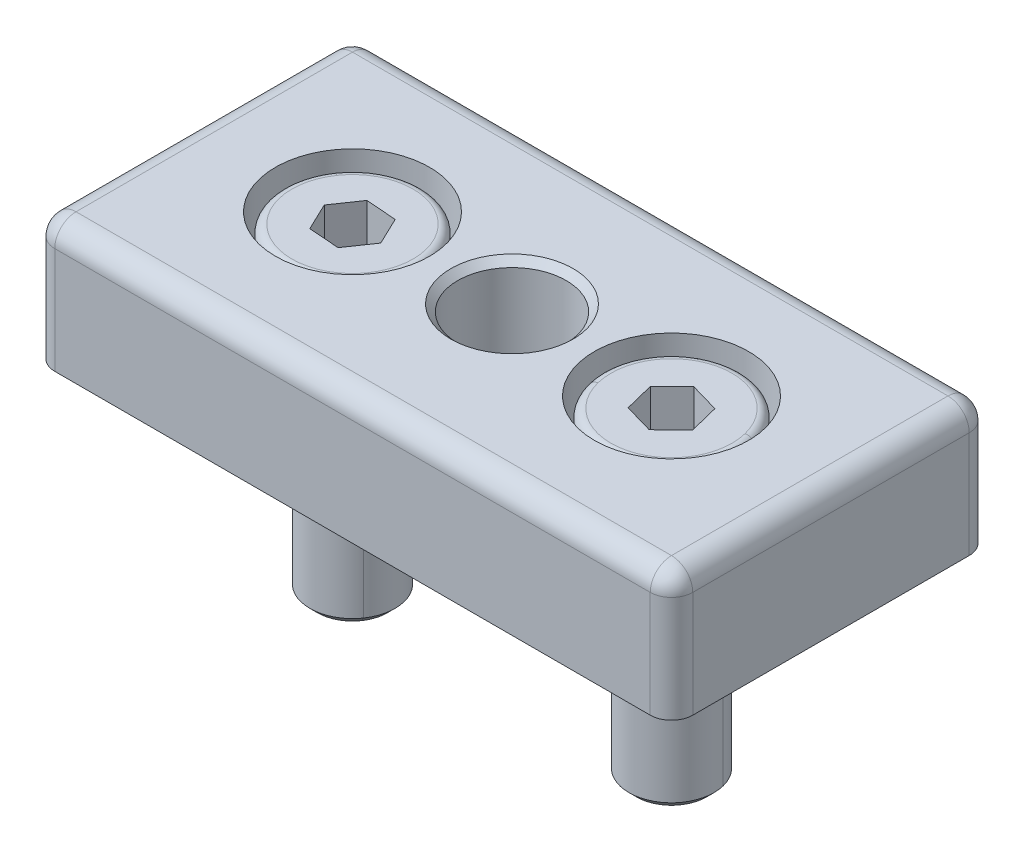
ISO-10303-21;
HEADER;
FILE_DESCRIPTION(('STEP AP214'),'2;1');
FILE_NAME('part.step','',(''),(''),'','','');
FILE_SCHEMA(('AUTOMOTIVE_DESIGN { 1 0 10303 214 1 1 1 1 }'));
ENDSEC;
DATA;
#1=APPLICATION_CONTEXT('core data for automotive mechanical design processes');
#2=APPLICATION_PROTOCOL_DEFINITION('international standard','automotive_design',2000,#1);
#3=PRODUCT_CONTEXT('',#1,'mechanical');
#4=PRODUCT('Part','Part','',(#3));
#5=PRODUCT_RELATED_PRODUCT_CATEGORY('part','',(#4));
#6=PRODUCT_DEFINITION_FORMATION('','',#4);
#7=PRODUCT_DEFINITION_CONTEXT('part definition',#1,'design');
#8=PRODUCT_DEFINITION('design','',#6,#7);
#9=PRODUCT_DEFINITION_SHAPE('','',#8);
#10=(LENGTH_UNIT() NAMED_UNIT(*) SI_UNIT(.MILLI.,.METRE.));
#11=(NAMED_UNIT(*) PLANE_ANGLE_UNIT() SI_UNIT($,.RADIAN.));
#12=(NAMED_UNIT(*) SI_UNIT($,.STERADIAN.) SOLID_ANGLE_UNIT());
#13=UNCERTAINTY_MEASURE_WITH_UNIT(LENGTH_MEASURE(1.E-05),#10,'distance_accuracy_value','');
#14=(GEOMETRIC_REPRESENTATION_CONTEXT(3) GLOBAL_UNCERTAINTY_ASSIGNED_CONTEXT((#13)) GLOBAL_UNIT_ASSIGNED_CONTEXT((#10,
#11,#12)) REPRESENTATION_CONTEXT('',''));
#15=CARTESIAN_POINT('',(0.,0.,0.));
#16=DIRECTION('',(0.,0.,1.));
#17=DIRECTION('',(1.,0.,0.));
#18=AXIS2_PLACEMENT_3D('',#15,#16,#17);
#19=CARTESIAN_POINT('',(-31.3688365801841,-5.29088161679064,-15.8464645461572));
#20=DIRECTION('',(-1.,0.,0.));
#21=DIRECTION('',(0.,0.,1.));
#22=AXIS2_PLACEMENT_3D('',#19,#20,#21);
#23=PLANE('',#22);
#24=DIRECTION('',(0.,1.,0.));
#25=VECTOR('',#24,1.);
#26=CARTESIAN_POINT('',(-31.3688365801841,-5.29088161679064,-13.8464645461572));
#27=LINE('',#26,#25);
#28=CARTESIAN_POINT('',(-31.3688365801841,7.90911838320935,-13.8464645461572));
#29=VERTEX_POINT('',#28);
#30=CARTESIAN_POINT('',(-31.3688365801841,-2.09088161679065,-13.8464645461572));
#31=VERTEX_POINT('',#30);
#32=EDGE_CURVE('P0_E165',#29,#31,#27,.F.);
#33=ORIENTED_EDGE('',*,*,#32,.T.);
#34=DIRECTION('',(0.,0.,-1.));
#35=VECTOR('',#34,1.);
#36=CARTESIAN_POINT('',(-31.3688365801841,-2.09088161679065,12.1535354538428));
#37=LINE('',#36,#35);
#38=CARTESIAN_POINT('',(-31.3688365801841,-2.09088161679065,12.1535354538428));
#39=VERTEX_POINT('',#38);
#40=EDGE_CURVE('P0_E127',#39,#31,#37,.T.);
#41=ORIENTED_EDGE('',*,*,#40,.F.);
#42=DIRECTION('',(0.,1.,0.));
#43=VECTOR('',#42,1.);
#44=CARTESIAN_POINT('',(-31.3688365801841,-5.29088161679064,12.1535354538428));
#45=LINE('',#44,#43);
#46=CARTESIAN_POINT('',(-31.3688365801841,7.90911838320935,12.1535354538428));
#47=VERTEX_POINT('',#46);
#48=EDGE_CURVE('P0_E154',#39,#47,#45,.T.);
#49=ORIENTED_EDGE('',*,*,#48,.T.);
#50=DIRECTION('',(0.,0.,1.));
#51=VECTOR('',#50,1.);
#52=CARTESIAN_POINT('',(-31.3688365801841,7.90911838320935,-15.8464645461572));
#53=LINE('',#52,#51);
#54=EDGE_CURVE('P0_E162',#47,#29,#53,.F.);
#55=ORIENTED_EDGE('',*,*,#54,.T.);
#56=EDGE_LOOP('',(#33,#41,#49,#55));
#57=FACE_BOUND('',#56,.T.);
#58=ADVANCED_FACE('P0_F46',(#57),#23,.T.);
#59=CARTESIAN_POINT('',(28.6311634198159,-5.29088161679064,-15.8464645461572));
#60=DIRECTION('',(0.,0.,-1.));
#61=DIRECTION('',(-1.,0.,0.));
#62=AXIS2_PLACEMENT_3D('',#59,#60,#61);
#63=PLANE('',#62);
#64=DIRECTION('',(0.,1.,0.));
#65=VECTOR('',#64,1.);
#66=CARTESIAN_POINT('',(26.6311634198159,-5.29088161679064,-15.8464645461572));
#67=LINE('',#66,#65);
#68=CARTESIAN_POINT('',(26.6311634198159,7.90911838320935,-15.8464645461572));
#69=VERTEX_POINT('',#68);
#70=CARTESIAN_POINT('',(26.6311634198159,-2.09088161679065,-15.8464645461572));
#71=VERTEX_POINT('',#70);
#72=EDGE_CURVE('P0_E141',#69,#71,#67,.F.);
#73=ORIENTED_EDGE('',*,*,#72,.T.);
#74=DIRECTION('',(1.,0.,0.));
#75=VECTOR('',#74,1.);
#76=CARTESIAN_POINT('',(-29.3688365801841,-2.09088161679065,-15.8464645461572));
#77=LINE('',#76,#75);
#78=CARTESIAN_POINT('',(-29.3688365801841,-2.09088161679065,-15.8464645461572));
#79=VERTEX_POINT('',#78);
#80=EDGE_CURVE('P0_E64',#79,#71,#77,.T.);
#81=ORIENTED_EDGE('',*,*,#80,.F.);
#82=DIRECTION('',(0.,1.,0.));
#83=VECTOR('',#82,1.);
#84=CARTESIAN_POINT('',(-29.3688365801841,-5.29088161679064,-15.8464645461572));
#85=LINE('',#84,#83);
#86=CARTESIAN_POINT('',(-29.3688365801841,7.90911838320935,-15.8464645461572));
#87=VERTEX_POINT('',#86);
#88=EDGE_CURVE('P0_E138',#79,#87,#85,.T.);
#89=ORIENTED_EDGE('',*,*,#88,.T.);
#90=DIRECTION('',(-1.,0.,0.));
#91=VECTOR('',#90,1.);
#92=CARTESIAN_POINT('',(28.6311634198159,7.90911838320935,-15.8464645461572));
#93=LINE('',#92,#91);
#94=EDGE_CURVE('P0_E150',#87,#69,#93,.F.);
#95=ORIENTED_EDGE('',*,*,#94,.T.);
#96=EDGE_LOOP('',(#73,#81,#89,#95));
#97=FACE_BOUND('',#96,.T.);
#98=ADVANCED_FACE('P0_F137',(#97),#63,.T.);
#99=CARTESIAN_POINT('',(28.6311634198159,-5.29088161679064,14.1535354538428));
#100=DIRECTION('',(1.,0.,0.));
#101=DIRECTION('',(0.,0.,-1.));
#102=AXIS2_PLACEMENT_3D('',#99,#100,#101);
#103=PLANE('',#102);
#104=DIRECTION('',(0.,1.,0.));
#105=VECTOR('',#104,1.);
#106=CARTESIAN_POINT('',(28.6311634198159,-5.29088161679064,12.1535354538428));
#107=LINE('',#106,#105);
#108=CARTESIAN_POINT('',(28.6311634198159,7.90911838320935,12.1535354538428));
#109=VERTEX_POINT('',#108);
#110=CARTESIAN_POINT('',(28.6311634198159,-2.09088161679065,12.1535354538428));
#111=VERTEX_POINT('',#110);
#112=EDGE_CURVE('P0_E267',#109,#111,#107,.F.);
#113=ORIENTED_EDGE('',*,*,#112,.T.);
#114=DIRECTION('',(0.,0.,1.));
#115=VECTOR('',#114,1.);
#116=CARTESIAN_POINT('',(28.6311634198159,-2.09088161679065,-13.8464645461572));
#117=LINE('',#116,#115);
#118=CARTESIAN_POINT('',(28.6311634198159,-2.09088161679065,-13.8464645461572));
#119=VERTEX_POINT('',#118);
#120=EDGE_CURVE('P0_E277',#119,#111,#117,.T.);
#121=ORIENTED_EDGE('',*,*,#120,.F.);
#122=DIRECTION('',(0.,1.,0.));
#123=VECTOR('',#122,1.);
#124=CARTESIAN_POINT('',(28.6311634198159,-5.29088161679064,-13.8464645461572));
#125=LINE('',#124,#123);
#126=CARTESIAN_POINT('',(28.6311634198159,7.90911838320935,-13.8464645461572));
#127=VERTEX_POINT('',#126);
#128=EDGE_CURVE('P0_E156',#119,#127,#125,.T.);
#129=ORIENTED_EDGE('',*,*,#128,.T.);
#130=DIRECTION('',(0.,0.,-1.));
#131=VECTOR('',#130,1.);
#132=CARTESIAN_POINT('',(28.6311634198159,7.90911838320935,14.1535354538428));
#133=LINE('',#132,#131);
#134=EDGE_CURVE('P0_E264',#127,#109,#133,.F.);
#135=ORIENTED_EDGE('',*,*,#134,.T.);
#136=EDGE_LOOP('',(#113,#121,#129,#135));
#137=FACE_BOUND('',#136,.T.);
#138=ADVANCED_FACE('P0_F274',(#137),#103,.T.);
#139=CARTESIAN_POINT('',(-31.3688365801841,-5.29088161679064,14.1535354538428));
#140=DIRECTION('',(0.,0.,1.));
#141=DIRECTION('',(1.,0.,0.));
#142=AXIS2_PLACEMENT_3D('',#139,#140,#141);
#143=PLANE('',#142);
#144=DIRECTION('',(0.,1.,0.));
#145=VECTOR('',#144,1.);
#146=CARTESIAN_POINT('',(-29.3688365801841,-5.29088161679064,14.1535354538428));
#147=LINE('',#146,#145);
#148=CARTESIAN_POINT('',(-29.3688365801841,7.90911838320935,14.1535354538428));
#149=VERTEX_POINT('',#148);
#150=CARTESIAN_POINT('',(-29.3688365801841,-2.09088161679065,14.1535354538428));
#151=VERTEX_POINT('',#150);
#152=EDGE_CURVE('P0_E181',#149,#151,#147,.F.);
#153=ORIENTED_EDGE('',*,*,#152,.T.);
#154=DIRECTION('',(-1.,0.,0.));
#155=VECTOR('',#154,1.);
#156=CARTESIAN_POINT('',(26.6311634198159,-2.09088161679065,14.1535354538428));
#157=LINE('',#156,#155);
#158=CARTESIAN_POINT('',(26.6311634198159,-2.09088161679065,14.1535354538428));
#159=VERTEX_POINT('',#158);
#160=EDGE_CURVE('P0_E298',#159,#151,#157,.T.);
#161=ORIENTED_EDGE('',*,*,#160,.F.);
#162=DIRECTION('',(0.,1.,0.));
#163=VECTOR('',#162,1.);
#164=CARTESIAN_POINT('',(26.6311634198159,-5.29088161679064,14.1535354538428));
#165=LINE('',#164,#163);
#166=CARTESIAN_POINT('',(26.6311634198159,7.90911838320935,14.1535354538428));
#167=VERTEX_POINT('',#166);
#168=EDGE_CURVE('P0_E11',#159,#167,#165,.T.);
#169=ORIENTED_EDGE('',*,*,#168,.T.);
#170=DIRECTION('',(1.,0.,0.));
#171=VECTOR('',#170,1.);
#172=CARTESIAN_POINT('',(-31.3688365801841,7.90911838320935,14.1535354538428));
#173=LINE('',#172,#171);
#174=EDGE_CURVE('P0_E56',#167,#149,#173,.F.);
#175=ORIENTED_EDGE('',*,*,#174,.T.);
#176=EDGE_LOOP('',(#153,#161,#169,#175));
#177=FACE_BOUND('',#176,.T.);
#178=ADVANCED_FACE('P0_F346',(#177),#143,.T.);
#179=CARTESIAN_POINT('',(-16.368836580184,9.90911838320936,-0.846464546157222));
#180=DIRECTION('',(0.,1.,0.));
#181=DIRECTION('',(0.,0.,1.));
#182=AXIS2_PLACEMENT_3D('',#179,#180,#181);
#183=CYLINDRICAL_SURFACE('',#182,4.50000000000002);
#184=CARTESIAN_POINT('',(-16.368836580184,3.90911838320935,-0.846464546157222));
#185=DIRECTION('',(0.,1.,0.));
#186=DIRECTION('',(0.,0.,1.));
#187=AXIS2_PLACEMENT_3D('',#184,#185,#186);
#188=CIRCLE('',#187,4.50000000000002);
#189=CARTESIAN_POINT('',(-16.368836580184,3.90911838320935,3.6535354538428));
#190=VERTEX_POINT('',#189);
#191=EDGE_CURVE('P0_E260',#190,#190,#188,.T.);
#192=ORIENTED_EDGE('',*,*,#191,.T.);
#193=EDGE_LOOP('',(#192));
#194=FACE_BOUND('',#193,.T.);
#195=CARTESIAN_POINT('',(-16.368836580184,-2.09088161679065,-0.846464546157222));
#196=DIRECTION('',(0.,-1.,0.));
#197=DIRECTION('',(0.,0.,-1.));
#198=AXIS2_PLACEMENT_3D('',#195,#196,#197);
#199=CIRCLE('',#198,4.50000000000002);
#200=CARTESIAN_POINT('',(-16.368836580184,-2.09088161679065,-5.34646454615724));
#201=VERTEX_POINT('',#200);
#202=EDGE_CURVE('P0_E622',#201,#201,#199,.T.);
#203=ORIENTED_EDGE('',*,*,#202,.T.);
#204=EDGE_LOOP('',(#203));
#205=FACE_BOUND('',#204,.T.);
#206=ADVANCED_FACE('P0_F414',(#194,#205),#183,.F.);
#207=CARTESIAN_POINT('',(13.631163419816,9.90911838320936,-0.846464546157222));
#208=DIRECTION('',(0.,1.,0.));
#209=DIRECTION('',(0.,0.,1.));
#210=AXIS2_PLACEMENT_3D('',#207,#208,#209);
#211=CYLINDRICAL_SURFACE('',#210,4.50000000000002);
#212=CARTESIAN_POINT('',(13.631163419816,3.90911838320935,-0.846464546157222));
#213=DIRECTION('',(0.,1.,0.));
#214=DIRECTION('',(0.,0.,1.));
#215=AXIS2_PLACEMENT_3D('',#212,#213,#214);
#216=CIRCLE('',#215,4.50000000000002);
#217=CARTESIAN_POINT('',(13.631163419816,3.90911838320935,3.6535354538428));
#218=VERTEX_POINT('',#217);
#219=EDGE_CURVE('P0_E244',#218,#218,#216,.T.);
#220=ORIENTED_EDGE('',*,*,#219,.T.);
#221=EDGE_LOOP('',(#220));
#222=FACE_BOUND('',#221,.T.);
#223=CARTESIAN_POINT('',(13.631163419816,-2.09088161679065,-0.846464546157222));
#224=DIRECTION('',(0.,-1.,0.));
#225=DIRECTION('',(0.,0.,-1.));
#226=AXIS2_PLACEMENT_3D('',#223,#224,#225);
#227=CIRCLE('',#226,4.50000000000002);
#228=CARTESIAN_POINT('',(13.631163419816,-2.09088161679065,-5.34646454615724));
#229=VERTEX_POINT('',#228);
#230=EDGE_CURVE('P0_E133',#229,#229,#227,.T.);
#231=ORIENTED_EDGE('',*,*,#230,.T.);
#232=EDGE_LOOP('',(#231));
#233=FACE_BOUND('',#232,.T.);
#234=ADVANCED_FACE('P0_F412',(#222,#233),#211,.F.);
#235=CARTESIAN_POINT('',(-29.3688365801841,-5.29088161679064,12.1535354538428));
#236=DIRECTION('',(0.,1.,0.));
#237=DIRECTION('',(0.,0.,1.));
#238=AXIS2_PLACEMENT_3D('',#235,#236,#237);
#239=CYLINDRICAL_SURFACE('',#238,2.);
#240=ORIENTED_EDGE('',*,*,#48,.F.);
#241=CARTESIAN_POINT('',(-29.3688365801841,-2.09088161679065,12.1535354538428));
#242=DIRECTION('',(0.,-1.,0.));
#243=DIRECTION('',(0.,0.,-1.));
#244=AXIS2_PLACEMENT_3D('',#241,#242,#243);
#245=CIRCLE('',#244,2.);
#246=EDGE_CURVE('P0_E302',#151,#39,#245,.T.);
#247=ORIENTED_EDGE('',*,*,#246,.F.);
#248=ORIENTED_EDGE('',*,*,#152,.F.);
#249=CARTESIAN_POINT('',(-29.3688365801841,7.90911838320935,12.1535354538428));
#250=DIRECTION('',(0.,1.,0.));
#251=DIRECTION('',(0.,0.,1.));
#252=AXIS2_PLACEMENT_3D('',#249,#250,#251);
#253=CIRCLE('',#252,2.);
#254=EDGE_CURVE('P0_E228',#47,#149,#253,.T.);
#255=ORIENTED_EDGE('',*,*,#254,.F.);
#256=EDGE_LOOP('',(#240,#247,#248,#255));
#257=FACE_BOUND('',#256,.T.);
#258=ADVANCED_FACE('P0_F48',(#257),#239,.T.);
#259=CARTESIAN_POINT('',(26.6311634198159,-5.29088161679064,12.1535354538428));
#260=DIRECTION('',(0.,1.,0.));
#261=DIRECTION('',(0.,0.,1.));
#262=AXIS2_PLACEMENT_3D('',#259,#260,#261);
#263=CYLINDRICAL_SURFACE('',#262,2.);
#264=ORIENTED_EDGE('',*,*,#168,.F.);
#265=CARTESIAN_POINT('',(26.6311634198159,-2.09088161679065,12.1535354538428));
#266=DIRECTION('',(0.,-1.,0.));
#267=DIRECTION('',(0.,0.,-1.));
#268=AXIS2_PLACEMENT_3D('',#265,#266,#267);
#269=CIRCLE('',#268,2.);
#270=EDGE_CURVE('P0_E296',#111,#159,#269,.T.);
#271=ORIENTED_EDGE('',*,*,#270,.F.);
#272=ORIENTED_EDGE('',*,*,#112,.F.);
#273=CARTESIAN_POINT('',(26.6311634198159,7.90911838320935,12.1535354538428));
#274=DIRECTION('',(0.,1.,0.));
#275=DIRECTION('',(0.,0.,1.));
#276=AXIS2_PLACEMENT_3D('',#273,#274,#275);
#277=CIRCLE('',#276,2.);
#278=EDGE_CURVE('P0_E217',#167,#109,#277,.T.);
#279=ORIENTED_EDGE('',*,*,#278,.F.);
#280=EDGE_LOOP('',(#264,#271,#272,#279));
#281=FACE_BOUND('',#280,.T.);
#282=ADVANCED_FACE('P0_F294',(#281),#263,.T.);
#283=CARTESIAN_POINT('',(-29.3688365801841,-5.29088161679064,-13.8464645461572));
#284=DIRECTION('',(0.,1.,0.));
#285=DIRECTION('',(0.,0.,1.));
#286=AXIS2_PLACEMENT_3D('',#283,#284,#285);
#287=CYLINDRICAL_SURFACE('',#286,2.);
#288=ORIENTED_EDGE('',*,*,#88,.F.);
#289=CARTESIAN_POINT('',(-29.3688365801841,-2.09088161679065,-13.8464645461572));
#290=DIRECTION('',(0.,-1.,0.));
#291=DIRECTION('',(0.,0.,-1.));
#292=AXIS2_PLACEMENT_3D('',#289,#290,#291);
#293=CIRCLE('',#292,2.);
#294=EDGE_CURVE('P0_E123',#31,#79,#293,.T.);
#295=ORIENTED_EDGE('',*,*,#294,.F.);
#296=ORIENTED_EDGE('',*,*,#32,.F.);
#297=CARTESIAN_POINT('',(-29.3688365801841,7.90911838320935,-13.8464645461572));
#298=DIRECTION('',(0.,1.,0.));
#299=DIRECTION('',(0.,0.,1.));
#300=AXIS2_PLACEMENT_3D('',#297,#298,#299);
#301=CIRCLE('',#300,2.);
#302=EDGE_CURVE('P0_E147',#87,#29,#301,.T.);
#303=ORIENTED_EDGE('',*,*,#302,.F.);
#304=EDGE_LOOP('',(#288,#295,#296,#303));
#305=FACE_BOUND('',#304,.T.);
#306=ADVANCED_FACE('P0_F145',(#305),#287,.T.);
#307=CARTESIAN_POINT('',(26.6311634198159,-5.29088161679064,-13.8464645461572));
#308=DIRECTION('',(0.,1.,0.));
#309=DIRECTION('',(0.,0.,1.));
#310=AXIS2_PLACEMENT_3D('',#307,#308,#309);
#311=CYLINDRICAL_SURFACE('',#310,2.);
#312=ORIENTED_EDGE('',*,*,#128,.F.);
#313=CARTESIAN_POINT('',(26.6311634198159,-2.09088161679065,-13.8464645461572));
#314=DIRECTION('',(0.,-1.,0.));
#315=DIRECTION('',(0.,0.,-1.));
#316=AXIS2_PLACEMENT_3D('',#313,#314,#315);
#317=CIRCLE('',#316,2.);
#318=EDGE_CURVE('P0_E143',#71,#119,#317,.T.);
#319=ORIENTED_EDGE('',*,*,#318,.F.);
#320=ORIENTED_EDGE('',*,*,#72,.F.);
#321=CARTESIAN_POINT('',(26.6311634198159,7.90911838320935,-13.8464645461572));
#322=DIRECTION('',(0.,1.,0.));
#323=DIRECTION('',(0.,0.,1.));
#324=AXIS2_PLACEMENT_3D('',#321,#322,#323);
#325=CIRCLE('',#324,2.);
#326=EDGE_CURVE('P0_E187',#69,#127,#325,.F.);
#327=ORIENTED_EDGE('',*,*,#326,.T.);
#328=EDGE_LOOP('',(#312,#319,#320,#327));
#329=FACE_BOUND('',#328,.T.);
#330=ADVANCED_FACE('P0_F280',(#329),#311,.T.);
#331=CARTESIAN_POINT('',(-1.36883658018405,9.90911838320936,-0.846464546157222));
#332=DIRECTION('',(0.,1.,0.));
#333=DIRECTION('',(0.,0.,1.));
#334=AXIS2_PLACEMENT_3D('',#331,#332,#333);
#335=CYLINDRICAL_SURFACE('',#334,5.1);
#336=CARTESIAN_POINT('',(-1.36883658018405,9.25911838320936,-0.846464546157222));
#337=DIRECTION('',(0.,1.,0.));
#338=DIRECTION('',(0.,0.,1.));
#339=AXIS2_PLACEMENT_3D('',#336,#337,#338);
#340=CIRCLE('',#339,5.1);
#341=CARTESIAN_POINT('',(-1.36883658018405,9.25911838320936,4.25353545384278));
#342=VERTEX_POINT('',#341);
#343=EDGE_CURVE('P0_E192',#342,#342,#340,.T.);
#344=ORIENTED_EDGE('',*,*,#343,.T.);
#345=EDGE_LOOP('',(#344));
#346=FACE_BOUND('',#345,.T.);
#347=CARTESIAN_POINT('',(-1.36883658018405,-2.09088161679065,-0.846464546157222));
#348=DIRECTION('',(0.,-1.,0.));
#349=DIRECTION('',(0.,0.,-1.));
#350=AXIS2_PLACEMENT_3D('',#347,#348,#349);
#351=CIRCLE('',#350,5.1);
#352=CARTESIAN_POINT('',(-1.36883658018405,-2.09088161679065,-5.94646454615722));
#353=VERTEX_POINT('',#352);
#354=EDGE_CURVE('P0_E50',#353,#353,#351,.F.);
#355=ORIENTED_EDGE('',*,*,#354,.F.);
#356=EDGE_LOOP('',(#355));
#357=FACE_BOUND('',#356,.T.);
#358=ADVANCED_FACE('P0_F321',(#346,#357),#335,.F.);
#359=CARTESIAN_POINT('',(-1.36883658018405,9.90911838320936,-0.846464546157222));
#360=DIRECTION('',(0.,1.,0.));
#361=DIRECTION('',(0.,0.,1.));
#362=AXIS2_PLACEMENT_3D('',#359,#360,#361);
#363=PLANE('',#362);
#364=CARTESIAN_POINT('',(-1.36883658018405,9.90911838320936,-0.846464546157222));
#365=DIRECTION('',(0.,1.,0.));
#366=DIRECTION('',(0.,0.,1.));
#367=AXIS2_PLACEMENT_3D('',#364,#365,#366);
#368=CIRCLE('',#367,5.75);
#369=CARTESIAN_POINT('',(-1.36883658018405,9.90911838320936,4.90353545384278));
#370=VERTEX_POINT('',#369);
#371=EDGE_CURVE('P0_E310',#370,#370,#368,.T.);
#372=ORIENTED_EDGE('',*,*,#371,.F.);
#373=EDGE_LOOP('',(#372));
#374=FACE_BOUND('',#373,.T.);
#375=DIRECTION('',(0.,0.,-1.));
#376=VECTOR('',#375,1.);
#377=CARTESIAN_POINT('',(26.6311634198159,9.90911838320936,-0.846464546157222));
#378=LINE('',#377,#376);
#379=CARTESIAN_POINT('',(26.6311634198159,9.90911838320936,12.1535354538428));
#380=VERTEX_POINT('',#379);
#381=CARTESIAN_POINT('',(26.6311634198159,9.90911838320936,-13.8464645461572));
#382=VERTEX_POINT('',#381);
#383=EDGE_CURVE('P0_E174',#380,#382,#378,.T.);
#384=ORIENTED_EDGE('',*,*,#383,.T.);
#385=DIRECTION('',(-1.,0.,0.));
#386=VECTOR('',#385,1.);
#387=CARTESIAN_POINT('',(-1.36883658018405,9.90911838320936,-13.8464645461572));
#388=LINE('',#387,#386);
#389=CARTESIAN_POINT('',(-29.3688365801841,9.90911838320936,-13.8464645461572));
#390=VERTEX_POINT('',#389);
#391=EDGE_CURVE('P0_E177',#382,#390,#388,.T.);
#392=ORIENTED_EDGE('',*,*,#391,.T.);
#393=DIRECTION('',(0.,0.,1.));
#394=VECTOR('',#393,1.);
#395=CARTESIAN_POINT('',(-29.3688365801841,9.90911838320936,-0.846464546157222));
#396=LINE('',#395,#394);
#397=CARTESIAN_POINT('',(-29.3688365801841,9.90911838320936,12.1535354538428));
#398=VERTEX_POINT('',#397);
#399=EDGE_CURVE('P0_E171',#390,#398,#396,.T.);
#400=ORIENTED_EDGE('',*,*,#399,.T.);
#401=DIRECTION('',(1.,0.,0.));
#402=VECTOR('',#401,1.);
#403=CARTESIAN_POINT('',(-1.36883658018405,9.90911838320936,12.1535354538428));
#404=LINE('',#403,#402);
#405=EDGE_CURVE('P0_E168',#398,#380,#404,.T.);
#406=ORIENTED_EDGE('',*,*,#405,.T.);
#407=EDGE_LOOP('',(#384,#392,#400,#406));
#408=FACE_BOUND('',#407,.T.);
#409=CARTESIAN_POINT('',(13.631163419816,9.90911838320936,-0.846464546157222));
#410=DIRECTION('',(0.,1.,0.));
#411=DIRECTION('',(0.,0.,1.));
#412=AXIS2_PLACEMENT_3D('',#409,#410,#411);
#413=CIRCLE('',#412,7.25000000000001);
#414=CARTESIAN_POINT('',(13.631163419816,9.90911838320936,6.40353545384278));
#415=VERTEX_POINT('',#414);
#416=EDGE_CURVE('P0_E231',#415,#415,#413,.T.);
#417=ORIENTED_EDGE('',*,*,#416,.F.);
#418=EDGE_LOOP('',(#417));
#419=FACE_BOUND('',#418,.T.);
#420=CARTESIAN_POINT('',(-16.368836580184,9.90911838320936,-0.846464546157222));
#421=DIRECTION('',(0.,1.,0.));
#422=DIRECTION('',(0.,0.,1.));
#423=AXIS2_PLACEMENT_3D('',#420,#421,#422);
#424=CIRCLE('',#423,7.25000000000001);
#425=CARTESIAN_POINT('',(-16.368836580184,9.90911838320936,6.40353545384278));
#426=VERTEX_POINT('',#425);
#427=EDGE_CURVE('P0_E252',#426,#426,#424,.T.);
#428=ORIENTED_EDGE('',*,*,#427,.F.);
#429=EDGE_LOOP('',(#428));
#430=FACE_BOUND('',#429,.T.);
#431=ADVANCED_FACE('P0_F323',(#374,#408,#419,#430),#363,.T.);
#432=CARTESIAN_POINT('',(-11.868836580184,3.90911838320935,-0.846464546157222));
#433=DIRECTION('',(0.,-1.,0.));
#434=DIRECTION('',(0.,0.,-1.));
#435=AXIS2_PLACEMENT_3D('',#432,#433,#434);
#436=PLANE('',#435);
#437=ORIENTED_EDGE('',*,*,#191,.F.);
#438=EDGE_LOOP('',(#437));
#439=FACE_BOUND('',#438,.T.);
#440=CARTESIAN_POINT('',(-16.368836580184,3.90911838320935,-0.846464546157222));
#441=DIRECTION('',(0.,1.,0.));
#442=DIRECTION('',(0.,0.,1.));
#443=AXIS2_PLACEMENT_3D('',#440,#441,#442);
#444=CIRCLE('',#443,7.25000000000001);
#445=CARTESIAN_POINT('',(-16.368836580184,3.90911838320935,6.40353545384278));
#446=VERTEX_POINT('',#445);
#447=EDGE_CURVE('P0_E256',#446,#446,#444,.T.);
#448=ORIENTED_EDGE('',*,*,#447,.T.);
#449=EDGE_LOOP('',(#448));
#450=FACE_BOUND('',#449,.T.);
#451=ADVANCED_FACE('P0_F331',(#439,#450),#436,.F.);
#452=CARTESIAN_POINT('',(-16.368836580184,9.90911838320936,-0.846464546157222));
#453=DIRECTION('',(0.,1.,0.));
#454=DIRECTION('',(0.,0.,1.));
#455=AXIS2_PLACEMENT_3D('',#452,#453,#454);
#456=CYLINDRICAL_SURFACE('',#455,7.25000000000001);
#457=ORIENTED_EDGE('',*,*,#447,.F.);
#458=EDGE_LOOP('',(#457));
#459=FACE_BOUND('',#458,.T.);
#460=ORIENTED_EDGE('',*,*,#427,.T.);
#461=EDGE_LOOP('',(#460));
#462=FACE_BOUND('',#461,.T.);
#463=ADVANCED_FACE('P0_F398',(#459,#462),#456,.F.);
#464=CARTESIAN_POINT('',(18.131163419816,3.90911838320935,-0.846464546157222));
#465=DIRECTION('',(0.,-1.,0.));
#466=DIRECTION('',(0.,0.,-1.));
#467=AXIS2_PLACEMENT_3D('',#464,#465,#466);
#468=PLANE('',#467);
#469=ORIENTED_EDGE('',*,*,#219,.F.);
#470=EDGE_LOOP('',(#469));
#471=FACE_BOUND('',#470,.T.);
#472=CARTESIAN_POINT('',(13.631163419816,3.90911838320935,-0.846464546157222));
#473=DIRECTION('',(0.,1.,0.));
#474=DIRECTION('',(0.,0.,1.));
#475=AXIS2_PLACEMENT_3D('',#472,#473,#474);
#476=CIRCLE('',#475,7.25000000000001);
#477=CARTESIAN_POINT('',(13.631163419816,3.90911838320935,6.40353545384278));
#478=VERTEX_POINT('',#477);
#479=EDGE_CURVE('P0_E238',#478,#478,#476,.T.);
#480=ORIENTED_EDGE('',*,*,#479,.T.);
#481=EDGE_LOOP('',(#480));
#482=FACE_BOUND('',#481,.T.);
#483=ADVANCED_FACE('P0_F381',(#471,#482),#468,.F.);
#484=CARTESIAN_POINT('',(13.631163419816,9.90911838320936,-0.846464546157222));
#485=DIRECTION('',(0.,1.,0.));
#486=DIRECTION('',(0.,0.,1.));
#487=AXIS2_PLACEMENT_3D('',#484,#485,#486);
#488=CYLINDRICAL_SURFACE('',#487,7.25000000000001);
#489=ORIENTED_EDGE('',*,*,#479,.F.);
#490=EDGE_LOOP('',(#489));
#491=FACE_BOUND('',#490,.T.);
#492=ORIENTED_EDGE('',*,*,#416,.T.);
#493=EDGE_LOOP('',(#492));
#494=FACE_BOUND('',#493,.T.);
#495=ADVANCED_FACE('P0_F377',(#491,#494),#488,.F.);
#496=CARTESIAN_POINT('',(-29.3688365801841,7.90911838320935,12.1535354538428));
#497=DIRECTION('',(0.,0.,1.));
#498=DIRECTION('',(1.,0.,0.));
#499=AXIS2_PLACEMENT_3D('',#496,#497,#498);
#500=SPHERICAL_SURFACE('',#499,2.);
#501=CARTESIAN_POINT('',(-29.3688365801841,7.90911838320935,12.1535354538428));
#502=DIRECTION('',(0.,0.,1.));
#503=DIRECTION('',(1.,0.,0.));
#504=AXIS2_PLACEMENT_3D('',#501,#502,#503);
#505=CIRCLE('',#504,2.);
#506=EDGE_CURVE('P0_E221',#47,#398,#505,.F.);
#507=ORIENTED_EDGE('',*,*,#506,.F.);
#508=ORIENTED_EDGE('',*,*,#254,.T.);
#509=CARTESIAN_POINT('',(-29.3688365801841,7.90911838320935,12.1535354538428));
#510=DIRECTION('',(-1.,0.,0.));
#511=DIRECTION('',(0.,0.,1.));
#512=AXIS2_PLACEMENT_3D('',#509,#510,#511);
#513=CIRCLE('',#512,2.);
#514=EDGE_CURVE('P0_E225',#398,#149,#513,.F.);
#515=ORIENTED_EDGE('',*,*,#514,.F.);
#516=EDGE_LOOP('',(#507,#508,#515));
#517=FACE_BOUND('',#516,.T.);
#518=ADVANCED_FACE('P0_F373',(#517),#500,.T.);
#519=CARTESIAN_POINT('',(-1.36883658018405,7.90911838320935,12.1535354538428));
#520=DIRECTION('',(1.,0.,0.));
#521=DIRECTION('',(0.,0.,-1.));
#522=AXIS2_PLACEMENT_3D('',#519,#520,#521);
#523=CYLINDRICAL_SURFACE('',#522,2.);
#524=ORIENTED_EDGE('',*,*,#514,.T.);
#525=ORIENTED_EDGE('',*,*,#174,.F.);
#526=CARTESIAN_POINT('',(26.6311634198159,7.90911838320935,12.1535354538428));
#527=DIRECTION('',(1.,0.,0.));
#528=DIRECTION('',(0.,0.,-1.));
#529=AXIS2_PLACEMENT_3D('',#526,#527,#528);
#530=CIRCLE('',#529,2.);
#531=EDGE_CURVE('P0_E213',#380,#167,#530,.T.);
#532=ORIENTED_EDGE('',*,*,#531,.F.);
#533=ORIENTED_EDGE('',*,*,#405,.F.);
#534=EDGE_LOOP('',(#524,#525,#532,#533));
#535=FACE_BOUND('',#534,.T.);
#536=ADVANCED_FACE('P0_F369',(#535),#523,.T.);
#537=CARTESIAN_POINT('',(-29.3688365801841,7.90911838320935,-0.846464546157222));
#538=DIRECTION('',(0.,0.,1.));
#539=DIRECTION('',(1.,0.,0.));
#540=AXIS2_PLACEMENT_3D('',#537,#538,#539);
#541=CYLINDRICAL_SURFACE('',#540,2.);
#542=ORIENTED_EDGE('',*,*,#506,.T.);
#543=ORIENTED_EDGE('',*,*,#399,.F.);
#544=CARTESIAN_POINT('',(-29.3688365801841,7.90911838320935,-13.8464645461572));
#545=DIRECTION('',(0.,0.,-1.));
#546=DIRECTION('',(-1.,0.,0.));
#547=AXIS2_PLACEMENT_3D('',#544,#545,#546);
#548=CIRCLE('',#547,2.);
#549=EDGE_CURVE('P0_E209',#29,#390,#548,.T.);
#550=ORIENTED_EDGE('',*,*,#549,.F.);
#551=ORIENTED_EDGE('',*,*,#54,.F.);
#552=EDGE_LOOP('',(#542,#543,#550,#551));
#553=FACE_BOUND('',#552,.T.);
#554=ADVANCED_FACE('P0_F364',(#553),#541,.T.);
#555=CARTESIAN_POINT('',(26.6311634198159,7.90911838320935,12.1535354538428));
#556=DIRECTION('',(0.,0.,1.));
#557=DIRECTION('',(1.,0.,0.));
#558=AXIS2_PLACEMENT_3D('',#555,#556,#557);
#559=SPHERICAL_SURFACE('',#558,2.);
#560=ORIENTED_EDGE('',*,*,#531,.T.);
#561=ORIENTED_EDGE('',*,*,#278,.T.);
#562=CARTESIAN_POINT('',(26.6311634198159,7.90911838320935,12.1535354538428));
#563=DIRECTION('',(0.,0.,1.));
#564=DIRECTION('',(1.,0.,0.));
#565=AXIS2_PLACEMENT_3D('',#562,#563,#564);
#566=CIRCLE('',#565,2.);
#567=EDGE_CURVE('P0_E203',#380,#109,#566,.F.);
#568=ORIENTED_EDGE('',*,*,#567,.F.);
#569=EDGE_LOOP('',(#560,#561,#568));
#570=FACE_BOUND('',#569,.T.);
#571=ADVANCED_FACE('P0_F290',(#570),#559,.T.);
#572=CARTESIAN_POINT('',(-29.3688365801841,7.90911838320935,-13.8464645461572));
#573=DIRECTION('',(-1.,0.,0.));
#574=DIRECTION('',(0.,0.,1.));
#575=AXIS2_PLACEMENT_3D('',#572,#573,#574);
#576=SPHERICAL_SURFACE('',#575,2.);
#577=ORIENTED_EDGE('',*,*,#302,.T.);
#578=ORIENTED_EDGE('',*,*,#549,.T.);
#579=CARTESIAN_POINT('',(-29.3688365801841,7.90911838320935,-13.8464645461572));
#580=DIRECTION('',(-1.,0.,0.));
#581=DIRECTION('',(0.,0.,1.));
#582=AXIS2_PLACEMENT_3D('',#579,#580,#581);
#583=CIRCLE('',#582,2.);
#584=EDGE_CURVE('P0_E200',#87,#390,#583,.F.);
#585=ORIENTED_EDGE('',*,*,#584,.F.);
#586=EDGE_LOOP('',(#577,#578,#585));
#587=FACE_BOUND('',#586,.T.);
#588=ADVANCED_FACE('P0_F358',(#587),#576,.T.);
#589=CARTESIAN_POINT('',(26.6311634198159,7.90911838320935,-0.846464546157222));
#590=DIRECTION('',(0.,0.,-1.));
#591=DIRECTION('',(-1.,0.,0.));
#592=AXIS2_PLACEMENT_3D('',#589,#590,#591);
#593=CYLINDRICAL_SURFACE('',#592,2.);
#594=ORIENTED_EDGE('',*,*,#567,.T.);
#595=ORIENTED_EDGE('',*,*,#134,.F.);
#596=CARTESIAN_POINT('',(26.6311634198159,7.90911838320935,-13.8464645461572));
#597=DIRECTION('',(0.,0.,-1.));
#598=DIRECTION('',(-1.,0.,0.));
#599=AXIS2_PLACEMENT_3D('',#596,#597,#598);
#600=CIRCLE('',#599,2.);
#601=EDGE_CURVE('P0_E196',#382,#127,#600,.T.);
#602=ORIENTED_EDGE('',*,*,#601,.F.);
#603=ORIENTED_EDGE('',*,*,#383,.F.);
#604=EDGE_LOOP('',(#594,#595,#602,#603));
#605=FACE_BOUND('',#604,.T.);
#606=ADVANCED_FACE('P0_F287',(#605),#593,.T.);
#607=CARTESIAN_POINT('',(-1.36883658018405,7.90911838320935,-13.8464645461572));
#608=DIRECTION('',(-1.,0.,0.));
#609=DIRECTION('',(0.,0.,1.));
#610=AXIS2_PLACEMENT_3D('',#607,#608,#609);
#611=CYLINDRICAL_SURFACE('',#610,2.);
#612=ORIENTED_EDGE('',*,*,#584,.T.);
#613=ORIENTED_EDGE('',*,*,#391,.F.);
#614=CARTESIAN_POINT('',(26.6311634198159,7.90911838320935,-13.8464645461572));
#615=DIRECTION('',(1.,0.,0.));
#616=DIRECTION('',(0.,0.,-1.));
#617=AXIS2_PLACEMENT_3D('',#614,#615,#616);
#618=CIRCLE('',#617,2.);
#619=EDGE_CURVE('P0_E191',#69,#382,#618,.T.);
#620=ORIENTED_EDGE('',*,*,#619,.F.);
#621=ORIENTED_EDGE('',*,*,#94,.F.);
#622=EDGE_LOOP('',(#612,#613,#620,#621));
#623=FACE_BOUND('',#622,.T.);
#624=ADVANCED_FACE('P0_F352',(#623),#611,.T.);
#625=CARTESIAN_POINT('',(26.6311634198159,7.90911838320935,-13.8464645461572));
#626=DIRECTION('',(0.,1.,0.));
#627=DIRECTION('',(0.,0.,1.));
#628=AXIS2_PLACEMENT_3D('',#625,#626,#627);
#629=SPHERICAL_SURFACE('',#628,2.);
#630=ORIENTED_EDGE('',*,*,#619,.T.);
#631=ORIENTED_EDGE('',*,*,#601,.T.);
#632=ORIENTED_EDGE('',*,*,#326,.F.);
#633=EDGE_LOOP('',(#630,#631,#632));
#634=FACE_BOUND('',#633,.T.);
#635=ADVANCED_FACE('P0_F283',(#634),#629,.T.);
#636=CARTESIAN_POINT('',(-1.36883658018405,9.90911838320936,-0.846464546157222));
#637=DIRECTION('',(0.,1.,0.));
#638=DIRECTION('',(0.,0.,1.));
#639=AXIS2_PLACEMENT_3D('',#636,#637,#638);
#640=CONICAL_SURFACE('',#639,5.75,0.785398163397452);
#641=ORIENTED_EDGE('',*,*,#343,.F.);
#642=EDGE_LOOP('',(#641));
#643=FACE_BOUND('',#642,.T.);
#644=ORIENTED_EDGE('',*,*,#371,.T.);
#645=EDGE_LOOP('',(#644));
#646=FACE_BOUND('',#645,.T.);
#647=ADVANCED_FACE('P0_F351',(#643,#646),#640,.F.);
#648=CARTESIAN_POINT('',(-29.3688365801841,-2.09088161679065,-13.8464645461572));
#649=DIRECTION('',(0.,-1.,0.));
#650=DIRECTION('',(0.,0.,-1.));
#651=AXIS2_PLACEMENT_3D('',#648,#649,#650);
#652=PLANE('',#651);
#653=ORIENTED_EDGE('',*,*,#202,.F.);
#654=EDGE_LOOP('',(#653));
#655=FACE_BOUND('',#654,.T.);
#656=ORIENTED_EDGE('',*,*,#230,.F.);
#657=EDGE_LOOP('',(#656));
#658=FACE_BOUND('',#657,.T.);
#659=ORIENTED_EDGE('',*,*,#294,.T.);
#660=ORIENTED_EDGE('',*,*,#80,.T.);
#661=ORIENTED_EDGE('',*,*,#318,.T.);
#662=ORIENTED_EDGE('',*,*,#120,.T.);
#663=ORIENTED_EDGE('',*,*,#270,.T.);
#664=ORIENTED_EDGE('',*,*,#160,.T.);
#665=ORIENTED_EDGE('',*,*,#246,.T.);
#666=ORIENTED_EDGE('',*,*,#40,.T.);
#667=EDGE_LOOP('',(#659,#660,#661,#662,#663,#664,#665,#666));
#668=FACE_BOUND('',#667,.T.);
#669=ORIENTED_EDGE('',*,*,#354,.T.);
#670=EDGE_LOOP('',(#669));
#671=FACE_BOUND('',#670,.T.);
#672=ADVANCED_FACE('P0_F124',(#655,#658,#668,#671),#652,.T.);
#673=CLOSED_SHELL('',(#58,#98,#138,#178,#206,#234,#258,#282,#306,#330,#358,#431,#451,#463,#483,
#495,#518,#536,#554,#571,#588,#606,#624,#635,#647,#672));
#674=MANIFOLD_SOLID_BREP('P0_B2',#673);
#675=CARTESIAN_POINT('',(-16.368836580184,5.10911838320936,-0.84646454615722));
#676=DIRECTION('',(0.,1.,0.));
#677=DIRECTION('',(-0.82479122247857,0.,-0.56543738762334));
#678=AXIS2_PLACEMENT_3D('',#675,#676,#677);
#679=CONICAL_SURFACE('',#678,2.5,1.0471975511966);
#680=DIRECTION('',(0.714290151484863,0.5,0.48968314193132));
#681=VECTOR('',#680,1.);
#682=CARTESIAN_POINT('',(-14.3068585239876,5.10911838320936,0.567128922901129));
#683=LINE('',#682,#681);
#684=CARTESIAN_POINT('',(-16.368836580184,3.66574271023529,-0.84646454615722));
#685=VERTEX_POINT('',#684);
#686=CARTESIAN_POINT('',(-14.3068585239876,5.10911838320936,0.567128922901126));
#687=VERTEX_POINT('',#686);
#688=EDGE_CURVE('P1_E333',#685,#687,#683,.T.);
#689=ORIENTED_EDGE('',*,*,#688,.F.);
#690=DIRECTION('',(-0.714290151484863,0.5,-0.48968314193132));
#691=VECTOR('',#690,1.);
#692=CARTESIAN_POINT('',(-18.4308146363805,5.10911838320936,-2.26005801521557));
#693=LINE('',#692,#691);
#694=CARTESIAN_POINT('',(-18.4308146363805,5.10911838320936,-2.26005801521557));
#695=VERTEX_POINT('',#694);
#696=EDGE_CURVE('P1_E336',#685,#695,#693,.T.);
#697=ORIENTED_EDGE('',*,*,#696,.T.);
#698=CARTESIAN_POINT('',(-16.368836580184,5.10911838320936,-0.84646454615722));
#699=DIRECTION('',(0.,1.,0.));
#700=DIRECTION('',(-0.82479122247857,0.,-0.56543738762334));
#701=AXIS2_PLACEMENT_3D('',#698,#699,#700);
#702=CIRCLE('',#701,2.5);
#703=CARTESIAN_POINT('',(-18.6240334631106,5.10911838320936,0.232464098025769));
#704=VERTEX_POINT('',#703);
#705=EDGE_CURVE('P1_E11',#695,#704,#702,.T.);
#706=ORIENTED_EDGE('',*,*,#705,.T.);
#707=CARTESIAN_POINT('',(-16.368836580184,5.10911838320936,-0.84646454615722));
#708=DIRECTION('',(0.,1.,0.));
#709=DIRECTION('',(-0.82479122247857,0.,-0.56543738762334));
#710=AXIS2_PLACEMENT_3D('',#707,#708,#709);
#711=CIRCLE('',#710,2.5);
#712=CARTESIAN_POINT('',(-16.5620554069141,5.10911838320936,1.64605756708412));
#713=VERTEX_POINT('',#712);
#714=EDGE_CURVE('P1_E26',#704,#713,#711,.T.);
#715=ORIENTED_EDGE('',*,*,#714,.T.);
#716=CARTESIAN_POINT('',(-16.368836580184,5.10911838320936,-0.84646454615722));
#717=DIRECTION('',(0.,1.,0.));
#718=DIRECTION('',(-0.82479122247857,0.,-0.56543738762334));
#719=AXIS2_PLACEMENT_3D('',#716,#717,#718);
#720=CIRCLE('',#719,2.5);
#721=EDGE_CURVE('P1_E19',#713,#687,#720,.T.);
#722=ORIENTED_EDGE('',*,*,#721,.T.);
#723=EDGE_LOOP('',(#689,#697,#706,#715,#722));
#724=FACE_BOUND('',#723,.T.);
#725=ADVANCED_FACE('P1_F16',(#724),#679,.F.);
#726=CARTESIAN_POINT('',(-19.246953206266,5.10911838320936,-1.06957442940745));
#727=DIRECTION('',(0.,1.,0.));
#728=DIRECTION('',(-0.82479122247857,0.,-0.56543738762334));
#729=AXIS2_PLACEMENT_3D('',#726,#727,#728);
#730=PLANE('',#729);
#731=ORIENTED_EDGE('',*,*,#705,.F.);
#732=DIRECTION('',(-0.565437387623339,0.,0.82479122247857));
#733=VECTOR('',#732,1.);
#734=CARTESIAN_POINT('',(-17.6146760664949,5.10911838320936,-3.45054160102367));
#735=LINE('',#734,#733);
#736=CARTESIAN_POINT('',(-19.246953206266,5.10911838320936,-1.06957442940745));
#737=VERTEX_POINT('',#736);
#738=EDGE_CURVE('P1_E294',#695,#737,#735,.T.);
#739=ORIENTED_EDGE('',*,*,#738,.T.);
#740=DIRECTION('',(-0.431571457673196,0.,-0.902078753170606));
#741=VECTOR('',#740,1.);
#742=CARTESIAN_POINT('',(-18.0011137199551,5.10911838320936,1.53450262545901));
#743=LINE('',#742,#741);
#744=EDGE_CURVE('P1_E275',#704,#737,#743,.T.);
#745=ORIENTED_EDGE('',*,*,#744,.F.);
#746=EDGE_LOOP('',(#731,#739,#745));
#747=FACE_BOUND('',#746,.T.);
#748=ADVANCED_FACE('P1_F595',(#747),#730,.T.);
#749=CARTESIAN_POINT('',(-19.246953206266,5.10911838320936,-1.06957442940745));
#750=DIRECTION('',(0.,1.,0.));
#751=DIRECTION('',(-0.82479122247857,0.,-0.56543738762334));
#752=AXIS2_PLACEMENT_3D('',#749,#750,#751);
#753=PLANE('',#752);
#754=ORIENTED_EDGE('',*,*,#714,.F.);
#755=DIRECTION('',(-0.431571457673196,0.,-0.902078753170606));
#756=VECTOR('',#755,1.);
#757=CARTESIAN_POINT('',(-18.0011137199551,5.10911838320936,1.53450262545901));
#758=LINE('',#757,#756);
#759=CARTESIAN_POINT('',(-18.0011137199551,5.10911838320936,1.53450262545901));
#760=VERTEX_POINT('',#759);
#761=EDGE_CURVE('P1_E271',#760,#704,#758,.T.);
#762=ORIENTED_EDGE('',*,*,#761,.F.);
#763=DIRECTION('',(0.997008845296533,0.,0.0772875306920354));
#764=VECTOR('',#763,1.);
#765=CARTESIAN_POINT('',(-18.0011137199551,5.10911838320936,1.53450262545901));
#766=LINE('',#765,#764);
#767=EDGE_CURVE('P1_E207',#760,#713,#766,.T.);
#768=ORIENTED_EDGE('',*,*,#767,.T.);
#769=EDGE_LOOP('',(#754,#762,#768));
#770=FACE_BOUND('',#769,.T.);
#771=ADVANCED_FACE('P1_F596',(#770),#753,.T.);
#772=CARTESIAN_POINT('',(-19.246953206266,5.10911838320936,-1.06957442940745));
#773=DIRECTION('',(0.,1.,0.));
#774=DIRECTION('',(-0.82479122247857,0.,-0.56543738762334));
#775=AXIS2_PLACEMENT_3D('',#772,#773,#774);
#776=PLANE('',#775);
#777=ORIENTED_EDGE('',*,*,#721,.F.);
#778=DIRECTION('',(0.997008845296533,0.,0.0772875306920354));
#779=VECTOR('',#778,1.);
#780=CARTESIAN_POINT('',(-18.0011137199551,5.10911838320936,1.53450262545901));
#781=LINE('',#780,#779);
#782=CARTESIAN_POINT('',(-15.1229970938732,5.10911838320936,1.75761250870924));
#783=VERTEX_POINT('',#782);
#784=EDGE_CURVE('P1_E205',#713,#783,#781,.T.);
#785=ORIENTED_EDGE('',*,*,#784,.T.);
#786=DIRECTION('',(0.565437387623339,0.,-0.82479122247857));
#787=VECTOR('',#786,1.);
#788=CARTESIAN_POINT('',(-15.1229970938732,5.10911838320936,1.75761250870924));
#789=LINE('',#788,#787);
#790=EDGE_CURVE('P1_E175',#783,#687,#789,.T.);
#791=ORIENTED_EDGE('',*,*,#790,.T.);
#792=EDGE_LOOP('',(#777,#785,#791));
#793=FACE_BOUND('',#792,.T.);
#794=ADVANCED_FACE('P1_F606',(#793),#776,.T.);
#795=CARTESIAN_POINT('',(-19.246953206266,5.10911838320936,-1.06957442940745));
#796=DIRECTION('',(0.,1.,0.));
#797=DIRECTION('',(-0.82479122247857,0.,-0.56543738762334));
#798=AXIS2_PLACEMENT_3D('',#795,#796,#797);
#799=PLANE('',#798);
#800=CARTESIAN_POINT('',(-16.368836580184,5.10911838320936,-0.84646454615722));
#801=DIRECTION('',(0.,1.,0.));
#802=DIRECTION('',(-0.82479122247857,0.,-0.56543738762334));
#803=AXIS2_PLACEMENT_3D('',#800,#801,#802);
#804=CIRCLE('',#803,2.5);
#805=CARTESIAN_POINT('',(-14.1136396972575,5.10911838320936,-1.9253931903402));
#806=VERTEX_POINT('',#805);
#807=EDGE_CURVE('P1_E170',#687,#806,#804,.T.);
#808=ORIENTED_EDGE('',*,*,#807,.F.);
#809=DIRECTION('',(0.565437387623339,0.,-0.82479122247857));
#810=VECTOR('',#809,1.);
#811=CARTESIAN_POINT('',(-15.1229970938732,5.10911838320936,1.75761250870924));
#812=LINE('',#811,#810);
#813=CARTESIAN_POINT('',(-13.4907199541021,5.10911838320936,-0.623354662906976));
#814=VERTEX_POINT('',#813);
#815=EDGE_CURVE('P1_E163',#687,#814,#812,.T.);
#816=ORIENTED_EDGE('',*,*,#815,.T.);
#817=DIRECTION('',(0.431571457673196,0.,0.902078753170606));
#818=VECTOR('',#817,1.);
#819=CARTESIAN_POINT('',(-14.736559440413,5.10911838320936,-3.22743171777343));
#820=LINE('',#819,#818);
#821=EDGE_CURVE('P1_E167',#806,#814,#820,.T.);
#822=ORIENTED_EDGE('',*,*,#821,.F.);
#823=EDGE_LOOP('',(#808,#816,#822));
#824=FACE_BOUND('',#823,.T.);
#825=ADVANCED_FACE('P1_F165',(#824),#799,.T.);
#826=CARTESIAN_POINT('',(-19.246953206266,5.10911838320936,-1.06957442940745));
#827=DIRECTION('',(0.,1.,0.));
#828=DIRECTION('',(-0.82479122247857,0.,-0.56543738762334));
#829=AXIS2_PLACEMENT_3D('',#826,#827,#828);
#830=PLANE('',#829);
#831=CARTESIAN_POINT('',(-16.368836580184,5.10911838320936,-0.84646454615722));
#832=DIRECTION('',(0.,1.,0.));
#833=DIRECTION('',(-0.82479122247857,0.,-0.56543738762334));
#834=AXIS2_PLACEMENT_3D('',#831,#832,#833);
#835=CIRCLE('',#834,2.5);
#836=CARTESIAN_POINT('',(-16.175617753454,5.10911838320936,-3.33898665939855));
#837=VERTEX_POINT('',#836);
#838=EDGE_CURVE('P1_E317',#806,#837,#835,.T.);
#839=ORIENTED_EDGE('',*,*,#838,.F.);
#840=DIRECTION('',(0.431571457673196,0.,0.902078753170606));
#841=VECTOR('',#840,1.);
#842=CARTESIAN_POINT('',(-14.736559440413,5.10911838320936,-3.22743171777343));
#843=LINE('',#842,#841);
#844=CARTESIAN_POINT('',(-14.736559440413,5.10911838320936,-3.22743171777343));
#845=VERTEX_POINT('',#844);
#846=EDGE_CURVE('P1_E189',#845,#806,#843,.T.);
#847=ORIENTED_EDGE('',*,*,#846,.F.);
#848=DIRECTION('',(0.997008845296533,0.,0.0772875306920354));
#849=VECTOR('',#848,1.);
#850=CARTESIAN_POINT('',(-17.6146760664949,5.10911838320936,-3.45054160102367));
#851=LINE('',#850,#849);
#852=EDGE_CURVE('P1_E291',#837,#845,#851,.T.);
#853=ORIENTED_EDGE('',*,*,#852,.F.);
#854=EDGE_LOOP('',(#839,#847,#853));
#855=FACE_BOUND('',#854,.T.);
#856=ADVANCED_FACE('P1_F315',(#855),#830,.T.);
#857=CARTESIAN_POINT('',(-19.246953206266,5.10911838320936,-1.06957442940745));
#858=DIRECTION('',(0.,1.,0.));
#859=DIRECTION('',(-0.82479122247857,0.,-0.56543738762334));
#860=AXIS2_PLACEMENT_3D('',#857,#858,#859);
#861=PLANE('',#860);
#862=CARTESIAN_POINT('',(-16.368836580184,5.10911838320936,-0.84646454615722));
#863=DIRECTION('',(0.,1.,0.));
#864=DIRECTION('',(-0.82479122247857,0.,-0.56543738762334));
#865=AXIS2_PLACEMENT_3D('',#862,#863,#864);
#866=CIRCLE('',#865,2.5);
#867=EDGE_CURVE('P1_E344',#837,#695,#866,.T.);
#868=ORIENTED_EDGE('',*,*,#867,.F.);
#869=DIRECTION('',(0.997008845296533,0.,0.0772875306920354));
#870=VECTOR('',#869,1.);
#871=CARTESIAN_POINT('',(-17.6146760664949,5.10911838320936,-3.45054160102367));
#872=LINE('',#871,#870);
#873=CARTESIAN_POINT('',(-17.6146760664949,5.10911838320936,-3.45054160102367));
#874=VERTEX_POINT('',#873);
#875=EDGE_CURVE('P1_E302',#874,#837,#872,.T.);
#876=ORIENTED_EDGE('',*,*,#875,.F.);
#877=DIRECTION('',(-0.565437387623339,0.,0.82479122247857));
#878=VECTOR('',#877,1.);
#879=CARTESIAN_POINT('',(-17.6146760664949,5.10911838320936,-3.45054160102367));
#880=LINE('',#879,#878);
#881=EDGE_CURVE('P1_E297',#874,#695,#880,.T.);
#882=ORIENTED_EDGE('',*,*,#881,.T.);
#883=EDGE_LOOP('',(#868,#876,#882));
#884=FACE_BOUND('',#883,.T.);
#885=ADVANCED_FACE('P1_F587',(#884),#861,.T.);
#886=CARTESIAN_POINT('',(-18.0011137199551,5.10911838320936,1.53450262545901));
#887=DIRECTION('',(-0.0772875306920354,0.,0.997008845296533));
#888=DIRECTION('',(0.,1.,0.));
#889=AXIS2_PLACEMENT_3D('',#886,#887,#888);
#890=PLANE('',#889);
#891=DIRECTION('',(0.997008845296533,0.,0.0772875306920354));
#892=VECTOR('',#891,1.);
#893=CARTESIAN_POINT('',(-18.0011137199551,8.90911838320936,1.53450262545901));
#894=LINE('',#893,#892);
#895=CARTESIAN_POINT('',(-18.0011137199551,8.90911838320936,1.53450262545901));
#896=VERTEX_POINT('',#895);
#897=CARTESIAN_POINT('',(-15.1229970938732,8.90911838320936,1.75761250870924));
#898=VERTEX_POINT('',#897);
#899=EDGE_CURVE('P1_E260',#896,#898,#894,.T.);
#900=ORIENTED_EDGE('',*,*,#899,.T.);
#901=DIRECTION('',(0.,1.,0.));
#902=VECTOR('',#901,1.);
#903=CARTESIAN_POINT('',(-15.1229970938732,5.10911838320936,1.75761250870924));
#904=LINE('',#903,#902);
#905=EDGE_CURVE('P1_E203',#783,#898,#904,.T.);
#906=ORIENTED_EDGE('',*,*,#905,.F.);
#907=ORIENTED_EDGE('',*,*,#784,.F.);
#908=ORIENTED_EDGE('',*,*,#767,.F.);
#909=DIRECTION('',(0.,1.,0.));
#910=VECTOR('',#909,1.);
#911=CARTESIAN_POINT('',(-18.0011137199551,5.10911838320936,1.53450262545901));
#912=LINE('',#911,#910);
#913=EDGE_CURVE('P1_E276',#760,#896,#912,.T.);
#914=ORIENTED_EDGE('',*,*,#913,.T.);
#915=EDGE_LOOP('',(#900,#906,#907,#908,#914));
#916=FACE_BOUND('',#915,.T.);
#917=ADVANCED_FACE('P1_F603',(#916),#890,.F.);
#918=CARTESIAN_POINT('',(-15.1229970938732,5.10911838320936,1.75761250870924));
#919=DIRECTION('',(0.82479122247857,0.,0.565437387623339));
#920=DIRECTION('',(0.565437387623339,0.,-0.82479122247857));
#921=AXIS2_PLACEMENT_3D('',#918,#919,#920);
#922=PLANE('',#921);
#923=DIRECTION('',(0.565437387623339,0.,-0.82479122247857));
#924=VECTOR('',#923,1.);
#925=CARTESIAN_POINT('',(-15.1229970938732,8.90911838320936,1.75761250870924));
#926=LINE('',#925,#924);
#927=CARTESIAN_POINT('',(-13.4907199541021,8.90911838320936,-0.623354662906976));
#928=VERTEX_POINT('',#927);
#929=EDGE_CURVE('P1_E181',#898,#928,#926,.T.);
#930=ORIENTED_EDGE('',*,*,#929,.T.);
#931=DIRECTION('',(0.,1.,0.));
#932=VECTOR('',#931,1.);
#933=CARTESIAN_POINT('',(-13.4907199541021,5.10911838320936,-0.623354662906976));
#934=LINE('',#933,#932);
#935=EDGE_CURVE('P1_E176',#814,#928,#934,.T.);
#936=ORIENTED_EDGE('',*,*,#935,.F.);
#937=ORIENTED_EDGE('',*,*,#815,.F.);
#938=ORIENTED_EDGE('',*,*,#790,.F.);
#939=ORIENTED_EDGE('',*,*,#905,.T.);
#940=EDGE_LOOP('',(#930,#936,#937,#938,#939));
#941=FACE_BOUND('',#940,.T.);
#942=ADVANCED_FACE('P1_F179',(#941),#922,.F.);
#943=CARTESIAN_POINT('',(-14.736559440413,5.10911838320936,-3.22743171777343));
#944=DIRECTION('',(-0.902078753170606,0.,0.431571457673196));
#945=DIRECTION('',(0.,-1.,0.));
#946=AXIS2_PLACEMENT_3D('',#943,#944,#945);
#947=PLANE('',#946);
#948=DIRECTION('',(0.431571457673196,0.,0.902078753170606));
#949=VECTOR('',#948,1.);
#950=CARTESIAN_POINT('',(-14.736559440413,8.90911838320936,-3.22743171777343));
#951=LINE('',#950,#949);
#952=CARTESIAN_POINT('',(-14.736559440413,8.90911838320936,-3.22743171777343));
#953=VERTEX_POINT('',#952);
#954=EDGE_CURVE('P1_E254',#953,#928,#951,.T.);
#955=ORIENTED_EDGE('',*,*,#954,.F.);
#956=DIRECTION('',(0.,1.,0.));
#957=VECTOR('',#956,1.);
#958=CARTESIAN_POINT('',(-14.736559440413,5.10911838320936,-3.22743171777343));
#959=LINE('',#958,#957);
#960=EDGE_CURVE('P1_E197',#845,#953,#959,.T.);
#961=ORIENTED_EDGE('',*,*,#960,.F.);
#962=ORIENTED_EDGE('',*,*,#846,.T.);
#963=ORIENTED_EDGE('',*,*,#821,.T.);
#964=ORIENTED_EDGE('',*,*,#935,.T.);
#965=EDGE_LOOP('',(#955,#961,#962,#963,#964));
#966=FACE_BOUND('',#965,.T.);
#967=ADVANCED_FACE('P1_F187',(#966),#947,.T.);
#968=CARTESIAN_POINT('',(-17.6146760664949,5.10911838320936,-3.45054160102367));
#969=DIRECTION('',(-0.0772875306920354,0.,0.997008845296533));
#970=DIRECTION('',(0.,1.,0.));
#971=AXIS2_PLACEMENT_3D('',#968,#969,#970);
#972=PLANE('',#971);
#973=DIRECTION('',(0.997008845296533,0.,0.0772875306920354));
#974=VECTOR('',#973,1.);
#975=CARTESIAN_POINT('',(-17.6146760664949,8.90911838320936,-3.45054160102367));
#976=LINE('',#975,#974);
#977=CARTESIAN_POINT('',(-17.6146760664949,8.90911838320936,-3.45054160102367));
#978=VERTEX_POINT('',#977);
#979=EDGE_CURVE('P1_E257',#978,#953,#976,.T.);
#980=ORIENTED_EDGE('',*,*,#979,.F.);
#981=DIRECTION('',(0.,1.,0.));
#982=VECTOR('',#981,1.);
#983=CARTESIAN_POINT('',(-17.6146760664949,5.10911838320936,-3.45054160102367));
#984=LINE('',#983,#982);
#985=EDGE_CURVE('P1_E301',#874,#978,#984,.T.);
#986=ORIENTED_EDGE('',*,*,#985,.F.);
#987=ORIENTED_EDGE('',*,*,#875,.T.);
#988=ORIENTED_EDGE('',*,*,#852,.T.);
#989=ORIENTED_EDGE('',*,*,#960,.T.);
#990=EDGE_LOOP('',(#980,#986,#987,#988,#989));
#991=FACE_BOUND('',#990,.T.);
#992=ADVANCED_FACE('P1_F311',(#991),#972,.T.);
#993=CARTESIAN_POINT('',(-17.6146760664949,5.10911838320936,-3.45054160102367));
#994=DIRECTION('',(-0.82479122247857,0.,-0.565437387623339));
#995=DIRECTION('',(0.565437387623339,0.,-0.82479122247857));
#996=AXIS2_PLACEMENT_3D('',#993,#994,#995);
#997=PLANE('',#996);
#998=DIRECTION('',(-0.565437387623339,0.,0.82479122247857));
#999=VECTOR('',#998,1.);
#1000=CARTESIAN_POINT('',(-17.6146760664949,8.90911838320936,-3.45054160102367));
#1001=LINE('',#1000,#999);
#1002=CARTESIAN_POINT('',(-19.246953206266,8.90911838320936,-1.06957442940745));
#1003=VERTEX_POINT('',#1002);
#1004=EDGE_CURVE('P1_E251',#978,#1003,#1001,.T.);
#1005=ORIENTED_EDGE('',*,*,#1004,.T.);
#1006=DIRECTION('',(0.,1.,0.));
#1007=VECTOR('',#1006,1.);
#1008=CARTESIAN_POINT('',(-19.246953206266,5.10911838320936,-1.06957442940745));
#1009=LINE('',#1008,#1007);
#1010=EDGE_CURVE('P1_E288',#737,#1003,#1009,.T.);
#1011=ORIENTED_EDGE('',*,*,#1010,.F.);
#1012=ORIENTED_EDGE('',*,*,#738,.F.);
#1013=ORIENTED_EDGE('',*,*,#881,.F.);
#1014=ORIENTED_EDGE('',*,*,#985,.T.);
#1015=EDGE_LOOP('',(#1005,#1011,#1012,#1013,#1014));
#1016=FACE_BOUND('',#1015,.T.);
#1017=ADVANCED_FACE('P1_F592',(#1016),#997,.F.);
#1018=CARTESIAN_POINT('',(-18.0011137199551,5.10911838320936,1.53450262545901));
#1019=DIRECTION('',(0.902078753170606,0.,-0.431571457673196));
#1020=DIRECTION('',(0.431571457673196,0.,0.902078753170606));
#1021=AXIS2_PLACEMENT_3D('',#1018,#1019,#1020);
#1022=PLANE('',#1021);
#1023=DIRECTION('',(-0.431571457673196,0.,-0.902078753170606));
#1024=VECTOR('',#1023,1.);
#1025=CARTESIAN_POINT('',(-18.0011137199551,8.90911838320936,1.53450262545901));
#1026=LINE('',#1025,#1024);
#1027=EDGE_CURVE('P1_E247',#896,#1003,#1026,.T.);
#1028=ORIENTED_EDGE('',*,*,#1027,.F.);
#1029=ORIENTED_EDGE('',*,*,#913,.F.);
#1030=ORIENTED_EDGE('',*,*,#761,.T.);
#1031=ORIENTED_EDGE('',*,*,#744,.T.);
#1032=ORIENTED_EDGE('',*,*,#1010,.T.);
#1033=EDGE_LOOP('',(#1028,#1029,#1030,#1031,#1032));
#1034=FACE_BOUND('',#1033,.T.);
#1035=ADVANCED_FACE('P1_F600',(#1034),#1022,.T.);
#1036=CARTESIAN_POINT('',(-16.368836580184,8.10911838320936,-0.84646454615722));
#1037=DIRECTION('',(0.,1.,0.));
#1038=DIRECTION('',(-0.82479122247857,0.,-0.56543738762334));
#1039=AXIS2_PLACEMENT_3D('',#1036,#1037,#1038);
#1040=TOROIDAL_SURFACE('',#1039,5.7,0.8);
#1041=CARTESIAN_POINT('',(-11.6675266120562,8.10911838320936,2.37652856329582));
#1042=DIRECTION('',(-0.56543738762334,0.,0.82479122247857));
#1043=DIRECTION('',(-0.82479122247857,0.,-0.56543738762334));
#1044=AXIS2_PLACEMENT_3D('',#1041,#1042,#1043);
#1045=CIRCLE('',#1044,0.8);
#1046=CARTESIAN_POINT('',(-11.0076936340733,8.10911838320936,2.82887847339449));
#1047=VERTEX_POINT('',#1046);
#1048=CARTESIAN_POINT('',(-11.6675266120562,8.90911838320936,2.37652856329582));
#1049=VERTEX_POINT('',#1048);
#1050=EDGE_CURVE('P1_E343',#1047,#1049,#1045,.T.);
#1051=ORIENTED_EDGE('',*,*,#1050,.F.);
#1052=CARTESIAN_POINT('',(-16.368836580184,8.10911838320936,-0.84646454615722));
#1053=DIRECTION('',(0.,-1.,0.));
#1054=DIRECTION('',(-0.82479122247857,0.,-0.56543738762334));
#1055=AXIS2_PLACEMENT_3D('',#1052,#1053,#1054);
#1056=CIRCLE('',#1055,6.5);
#1057=CARTESIAN_POINT('',(-21.7299795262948,8.10911838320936,-4.52180756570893));
#1058=VERTEX_POINT('',#1057);
#1059=EDGE_CURVE('P1_E267',#1058,#1047,#1056,.T.);
#1060=ORIENTED_EDGE('',*,*,#1059,.F.);
#1061=CARTESIAN_POINT('',(-21.0701465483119,8.10911838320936,-4.06945765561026));
#1062=DIRECTION('',(0.56543738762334,0.,-0.82479122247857));
#1063=DIRECTION('',(0.82479122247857,0.,0.56543738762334));
#1064=AXIS2_PLACEMENT_3D('',#1061,#1062,#1063);
#1065=CIRCLE('',#1064,0.8);
#1066=CARTESIAN_POINT('',(-21.0701465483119,8.90911838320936,-4.06945765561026));
#1067=VERTEX_POINT('',#1066);
#1068=EDGE_CURVE('P1_E362',#1058,#1067,#1065,.T.);
#1069=ORIENTED_EDGE('',*,*,#1068,.T.);
#1070=CARTESIAN_POINT('',(-16.368836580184,8.90911838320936,-0.84646454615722));
#1071=DIRECTION('',(0.,1.,0.));
#1072=DIRECTION('',(-0.82479122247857,0.,-0.56543738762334));
#1073=AXIS2_PLACEMENT_3D('',#1070,#1071,#1072);
#1074=CIRCLE('',#1073,5.7);
#1075=EDGE_CURVE('P1_E244',#1049,#1067,#1074,.T.);
#1076=ORIENTED_EDGE('',*,*,#1075,.F.);
#1077=EDGE_LOOP('',(#1051,#1060,#1069,#1076));
#1078=FACE_BOUND('',#1077,.T.);
#1079=ADVANCED_FACE('P1_F636',(#1078),#1040,.T.);
#1080=CARTESIAN_POINT('',(-16.368836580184,3.50911838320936,-0.84646454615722));
#1081=DIRECTION('',(0.,-1.,0.));
#1082=DIRECTION('',(0.82479122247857,0.,0.56543738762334));
#1083=AXIS2_PLACEMENT_3D('',#1080,#1081,#1082);
#1084=TOROIDAL_SURFACE('',#1083,4.39999999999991,0.4);
#1085=CARTESIAN_POINT('',(-19.9979179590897,3.50911838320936,-3.33438905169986));
#1086=DIRECTION('',(-0.565437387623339,0.,0.82479122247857));
#1087=DIRECTION('',(-0.82479122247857,0.,-0.565437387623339));
#1088=AXIS2_PLACEMENT_3D('',#1085,#1086,#1087);
#1089=CIRCLE('',#1088,0.4);
#1090=CARTESIAN_POINT('',(-19.6680014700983,3.50911838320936,-3.10821409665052));
#1091=VERTEX_POINT('',#1090);
#1092=CARTESIAN_POINT('',(-19.9979179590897,3.90911838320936,-3.33438905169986));
#1093=VERTEX_POINT('',#1092);
#1094=EDGE_CURVE('P1_E372',#1091,#1093,#1089,.T.);
#1095=ORIENTED_EDGE('',*,*,#1094,.F.);
#1096=CARTESIAN_POINT('',(-16.368836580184,3.50911838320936,-0.84646454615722));
#1097=DIRECTION('',(0.,-1.,0.));
#1098=DIRECTION('',(0.82479122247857,0.,0.56543738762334));
#1099=AXIS2_PLACEMENT_3D('',#1096,#1097,#1098);
#1100=CIRCLE('',#1099,3.99999999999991);
#1101=CARTESIAN_POINT('',(-13.0696716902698,3.50911838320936,1.41528500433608));
#1102=VERTEX_POINT('',#1101);
#1103=EDGE_CURVE('P1_E227',#1102,#1091,#1100,.T.);
#1104=ORIENTED_EDGE('',*,*,#1103,.F.);
#1105=CARTESIAN_POINT('',(-12.7397552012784,3.50911838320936,1.64145995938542));
#1106=DIRECTION('',(0.56543738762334,0.,-0.82479122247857));
#1107=DIRECTION('',(0.82479122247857,0.,0.56543738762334));
#1108=AXIS2_PLACEMENT_3D('',#1105,#1106,#1107);
#1109=CIRCLE('',#1108,0.4);
#1110=CARTESIAN_POINT('',(-12.7397552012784,3.90911838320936,1.64145995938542));
#1111=VERTEX_POINT('',#1110);
#1112=EDGE_CURVE('P1_E354',#1102,#1111,#1109,.T.);
#1113=ORIENTED_EDGE('',*,*,#1112,.T.);
#1114=CARTESIAN_POINT('',(-16.368836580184,3.90911838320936,-0.84646454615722));
#1115=DIRECTION('',(0.,1.,0.));
#1116=DIRECTION('',(0.82479122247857,0.,0.56543738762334));
#1117=AXIS2_PLACEMENT_3D('',#1114,#1115,#1116);
#1118=CIRCLE('',#1117,4.39999999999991);
#1119=EDGE_CURVE('P1_E270',#1093,#1111,#1118,.T.);
#1120=ORIENTED_EDGE('',*,*,#1119,.F.);
#1121=EDGE_LOOP('',(#1095,#1104,#1113,#1120));
#1122=FACE_BOUND('',#1121,.T.);
#1123=ADVANCED_FACE('P1_F639',(#1122),#1084,.F.);
#1124=CARTESIAN_POINT('',(-18.2401516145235,-21.0908816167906,1.88318200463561));
#1125=DIRECTION('',(0.,-1.,0.));
#1126=DIRECTION('',(-0.56543738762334,0.,0.82479122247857));
#1127=AXIS2_PLACEMENT_3D('',#1124,#1125,#1126);
#1128=PLANE('',#1127);
#1129=CARTESIAN_POINT('',(-16.368836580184,-21.0908816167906,-0.84646454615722));
#1130=DIRECTION('',(0.,1.,0.));
#1131=DIRECTION('',(-0.82479122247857,0.,-0.56543738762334));
#1132=AXIS2_PLACEMENT_3D('',#1129,#1130,#1131);
#1133=CIRCLE('',#1132,3.3095);
#1134=CARTESIAN_POINT('',(-19.0984831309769,-21.0908816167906,-2.71777958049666));
#1135=VERTEX_POINT('',#1134);
#1136=CARTESIAN_POINT('',(-13.6391900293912,-21.0908816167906,1.02485048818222));
#1137=VERTEX_POINT('',#1136);
#1138=EDGE_CURVE('P1_E350',#1135,#1137,#1133,.T.);
#1139=ORIENTED_EDGE('',*,*,#1138,.F.);
#1140=CARTESIAN_POINT('',(-16.368836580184,-21.0908816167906,-0.84646454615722));
#1141=DIRECTION('',(0.,1.,0.));
#1142=DIRECTION('',(-0.82479122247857,0.,-0.56543738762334));
#1143=AXIS2_PLACEMENT_3D('',#1140,#1141,#1142);
#1144=CIRCLE('',#1143,3.3095);
#1145=EDGE_CURVE('P1_E280',#1137,#1135,#1144,.T.);
#1146=ORIENTED_EDGE('',*,*,#1145,.F.);
#1147=EDGE_LOOP('',(#1139,#1146));
#1148=FACE_BOUND('',#1147,.T.);
#1149=ADVANCED_FACE('P1_F645',(#1148),#1128,.T.);
#1150=CARTESIAN_POINT('',(-16.368836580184,-21.0908816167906,-0.84646454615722));
#1151=DIRECTION('',(0.,1.,0.));
#1152=DIRECTION('',(-0.82479122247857,0.,-0.56543738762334));
#1153=AXIS2_PLACEMENT_3D('',#1150,#1151,#1152);
#1154=CONICAL_SURFACE('',#1153,3.3095,0.785398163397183);
#1155=DIRECTION('',(0.583215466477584,0.707106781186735,0.399824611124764));
#1156=VECTOR('',#1155,1.);
#1157=CARTESIAN_POINT('',(-13.6391900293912,-21.0908816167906,1.02485048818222));
#1158=LINE('',#1157,#1156);
#1159=CARTESIAN_POINT('',(-13.0696716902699,-20.4003816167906,1.41528500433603));
#1160=VERTEX_POINT('',#1159);
#1161=EDGE_CURVE('P1_E345',#1137,#1160,#1158,.T.);
#1162=ORIENTED_EDGE('',*,*,#1161,.F.);
#1163=ORIENTED_EDGE('',*,*,#1145,.T.);
#1164=DIRECTION('',(-0.583215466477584,0.707106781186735,-0.399824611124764));
#1165=VECTOR('',#1164,1.);
#1166=CARTESIAN_POINT('',(-19.0984831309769,-21.0908816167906,-2.71777958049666));
#1167=LINE('',#1166,#1165);
#1168=CARTESIAN_POINT('',(-19.6680014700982,-20.4003816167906,-3.10821409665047));
#1169=VERTEX_POINT('',#1168);
#1170=EDGE_CURVE('P1_E384',#1135,#1169,#1167,.T.);
#1171=ORIENTED_EDGE('',*,*,#1170,.T.);
#1172=CARTESIAN_POINT('',(-16.368836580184,-20.4003816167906,-0.84646454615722));
#1173=DIRECTION('',(0.,1.,0.));
#1174=DIRECTION('',(-0.82479122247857,0.,-0.56543738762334));
#1175=AXIS2_PLACEMENT_3D('',#1172,#1173,#1174);
#1176=CIRCLE('',#1175,3.99999999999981);
#1177=EDGE_CURVE('P1_E277',#1160,#1169,#1176,.T.);
#1178=ORIENTED_EDGE('',*,*,#1177,.F.);
#1179=EDGE_LOOP('',(#1162,#1163,#1171,#1178));
#1180=FACE_BOUND('',#1179,.T.);
#1181=ADVANCED_FACE('P1_F649',(#1180),#1154,.T.);
#1182=CARTESIAN_POINT('',(-16.368836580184,40.6591183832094,-0.84646454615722));
#1183=DIRECTION('',(0.,1.,0.));
#1184=DIRECTION('',(-0.82479122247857,0.,-0.56543738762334));
#1185=AXIS2_PLACEMENT_3D('',#1182,#1183,#1184);
#1186=CYLINDRICAL_SURFACE('',#1185,3.99999999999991);
#1187=DIRECTION('',(0.,1.,0.));
#1188=VECTOR('',#1187,1.);
#1189=CARTESIAN_POINT('',(-13.0696716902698,40.6591183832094,1.41528500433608));
#1190=LINE('',#1189,#1188);
#1191=EDGE_CURVE('P1_E225',#1160,#1102,#1190,.T.);
#1192=ORIENTED_EDGE('',*,*,#1191,.F.);
#1193=ORIENTED_EDGE('',*,*,#1177,.T.);
#1194=DIRECTION('',(0.,1.,0.));
#1195=VECTOR('',#1194,1.);
#1196=CARTESIAN_POINT('',(-19.6680014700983,40.6591183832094,-3.10821409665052));
#1197=LINE('',#1196,#1195);
#1198=EDGE_CURVE('P1_E231',#1169,#1091,#1197,.T.);
#1199=ORIENTED_EDGE('',*,*,#1198,.T.);
#1200=CARTESIAN_POINT('',(-16.368836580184,3.50911838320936,-0.84646454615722));
#1201=DIRECTION('',(0.,-1.,0.));
#1202=DIRECTION('',(0.82479122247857,0.,0.56543738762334));
#1203=AXIS2_PLACEMENT_3D('',#1200,#1201,#1202);
#1204=CIRCLE('',#1203,3.99999999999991);
#1205=EDGE_CURVE('P1_E366',#1091,#1102,#1204,.T.);
#1206=ORIENTED_EDGE('',*,*,#1205,.T.);
#1207=EDGE_LOOP('',(#1192,#1193,#1199,#1206));
#1208=FACE_BOUND('',#1207,.T.);
#1209=ADVANCED_FACE('P1_F414',(#1208),#1186,.T.);
#1210=CARTESIAN_POINT('',(-20.0441795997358,3.90911838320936,4.51467839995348));
#1211=DIRECTION('',(0.,-1.,0.));
#1212=DIRECTION('',(-0.56543738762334,0.,0.82479122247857));
#1213=AXIS2_PLACEMENT_3D('',#1210,#1211,#1212);
#1214=PLANE('',#1213);
#1215=CARTESIAN_POINT('',(-16.368836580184,3.90911838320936,-0.84646454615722));
#1216=DIRECTION('',(0.,1.,0.));
#1217=DIRECTION('',(0.82479122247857,0.,0.56543738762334));
#1218=AXIS2_PLACEMENT_3D('',#1215,#1216,#1217);
#1219=CIRCLE('',#1218,4.39999999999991);
#1220=EDGE_CURVE('P1_E376',#1111,#1093,#1219,.T.);
#1221=ORIENTED_EDGE('',*,*,#1220,.T.);
#1222=ORIENTED_EDGE('',*,*,#1119,.T.);
#1223=EDGE_LOOP('',(#1221,#1222));
#1224=FACE_BOUND('',#1223,.T.);
#1225=CARTESIAN_POINT('',(-16.368836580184,3.90911838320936,-0.84646454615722));
#1226=DIRECTION('',(0.,1.,0.));
#1227=DIRECTION('',(-0.82479122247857,0.,-0.56543738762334));
#1228=AXIS2_PLACEMENT_3D('',#1225,#1226,#1227);
#1229=CIRCLE('',#1228,6.5);
#1230=CARTESIAN_POINT('',(-21.7299795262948,3.90911838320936,-4.52180756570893));
#1231=VERTEX_POINT('',#1230);
#1232=CARTESIAN_POINT('',(-11.0076936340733,3.90911838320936,2.82887847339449));
#1233=VERTEX_POINT('',#1232);
#1234=EDGE_CURVE('P1_E235',#1231,#1233,#1229,.T.);
#1235=ORIENTED_EDGE('',*,*,#1234,.F.);
#1236=CARTESIAN_POINT('',(-16.368836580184,3.90911838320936,-0.84646454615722));
#1237=DIRECTION('',(0.,1.,0.));
#1238=DIRECTION('',(-0.82479122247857,0.,-0.56543738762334));
#1239=AXIS2_PLACEMENT_3D('',#1236,#1237,#1238);
#1240=CIRCLE('',#1239,6.5);
#1241=EDGE_CURVE('P1_E264',#1233,#1231,#1240,.T.);
#1242=ORIENTED_EDGE('',*,*,#1241,.F.);
#1243=EDGE_LOOP('',(#1235,#1242));
#1244=FACE_BOUND('',#1243,.T.);
#1245=ADVANCED_FACE('P1_F655',(#1224,#1244),#1214,.T.);
#1246=CARTESIAN_POINT('',(-16.368836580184,40.6591183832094,-0.84646454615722));
#1247=DIRECTION('',(0.,1.,0.));
#1248=DIRECTION('',(-0.82479122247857,0.,-0.56543738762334));
#1249=AXIS2_PLACEMENT_3D('',#1246,#1247,#1248);
#1250=CYLINDRICAL_SURFACE('',#1249,6.5);
#1251=DIRECTION('',(0.,1.,0.));
#1252=VECTOR('',#1251,1.);
#1253=CARTESIAN_POINT('',(-11.0076936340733,40.6591183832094,2.82887847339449));
#1254=LINE('',#1253,#1252);
#1255=EDGE_CURVE('P1_E236',#1233,#1047,#1254,.T.);
#1256=ORIENTED_EDGE('',*,*,#1255,.F.);
#1257=ORIENTED_EDGE('',*,*,#1241,.T.);
#1258=DIRECTION('',(0.,1.,0.));
#1259=VECTOR('',#1258,1.);
#1260=CARTESIAN_POINT('',(-21.7299795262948,40.6591183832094,-4.52180756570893));
#1261=LINE('',#1260,#1259);
#1262=EDGE_CURVE('P1_E240',#1231,#1058,#1261,.T.);
#1263=ORIENTED_EDGE('',*,*,#1262,.T.);
#1264=ORIENTED_EDGE('',*,*,#1059,.T.);
#1265=EDGE_LOOP('',(#1256,#1257,#1263,#1264));
#1266=FACE_BOUND('',#1265,.T.);
#1267=ADVANCED_FACE('P1_F658',(#1266),#1250,.T.);
#1268=CARTESIAN_POINT('',(-16.368836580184,8.90911838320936,-0.84646454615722));
#1269=DIRECTION('',(0.,1.,0.));
#1270=DIRECTION('',(-0.82479122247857,0.,-0.56543738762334));
#1271=AXIS2_PLACEMENT_3D('',#1268,#1269,#1270);
#1272=PLANE('',#1271);
#1273=ORIENTED_EDGE('',*,*,#1027,.T.);
#1274=ORIENTED_EDGE('',*,*,#1004,.F.);
#1275=ORIENTED_EDGE('',*,*,#979,.T.);
#1276=ORIENTED_EDGE('',*,*,#954,.T.);
#1277=ORIENTED_EDGE('',*,*,#929,.F.);
#1278=ORIENTED_EDGE('',*,*,#899,.F.);
#1279=EDGE_LOOP('',(#1273,#1274,#1275,#1276,#1277,#1278));
#1280=FACE_BOUND('',#1279,.T.);
#1281=CARTESIAN_POINT('',(-16.368836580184,8.90911838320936,-0.84646454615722));
#1282=DIRECTION('',(0.,1.,0.));
#1283=DIRECTION('',(-0.82479122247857,0.,-0.56543738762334));
#1284=AXIS2_PLACEMENT_3D('',#1281,#1282,#1283);
#1285=CIRCLE('',#1284,5.7);
#1286=EDGE_CURVE('P1_E358',#1067,#1049,#1285,.T.);
#1287=ORIENTED_EDGE('',*,*,#1286,.T.);
#1288=ORIENTED_EDGE('',*,*,#1075,.T.);
#1289=EDGE_LOOP('',(#1287,#1288));
#1290=FACE_BOUND('',#1289,.T.);
#1291=ADVANCED_FACE('P1_F321',(#1280,#1290),#1272,.T.);
#1292=CARTESIAN_POINT('',(-16.368836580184,40.6591183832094,-0.84646454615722));
#1293=DIRECTION('',(0.,1.,0.));
#1294=DIRECTION('',(-0.82479122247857,0.,-0.56543738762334));
#1295=AXIS2_PLACEMENT_3D('',#1292,#1293,#1294);
#1296=CYLINDRICAL_SURFACE('',#1295,6.5);
#1297=ORIENTED_EDGE('',*,*,#1234,.T.);
#1298=ORIENTED_EDGE('',*,*,#1255,.T.);
#1299=CARTESIAN_POINT('',(-16.368836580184,8.10911838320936,-0.84646454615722));
#1300=DIRECTION('',(0.,-1.,0.));
#1301=DIRECTION('',(-0.82479122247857,0.,-0.56543738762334));
#1302=AXIS2_PLACEMENT_3D('',#1299,#1300,#1301);
#1303=CIRCLE('',#1302,6.5);
#1304=EDGE_CURVE('P1_E339',#1047,#1058,#1303,.T.);
#1305=ORIENTED_EDGE('',*,*,#1304,.T.);
#1306=ORIENTED_EDGE('',*,*,#1262,.F.);
#1307=EDGE_LOOP('',(#1297,#1298,#1305,#1306));
#1308=FACE_BOUND('',#1307,.T.);
#1309=ADVANCED_FACE('P1_F665',(#1308),#1296,.T.);
#1310=CARTESIAN_POINT('',(-16.368836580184,40.6591183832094,-0.84646454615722));
#1311=DIRECTION('',(0.,1.,0.));
#1312=DIRECTION('',(-0.82479122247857,0.,-0.56543738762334));
#1313=AXIS2_PLACEMENT_3D('',#1310,#1311,#1312);
#1314=CYLINDRICAL_SURFACE('',#1313,3.99999999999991);
#1315=CARTESIAN_POINT('',(-16.368836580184,-20.4003816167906,-0.84646454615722));
#1316=DIRECTION('',(0.,1.,0.));
#1317=DIRECTION('',(-0.82479122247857,0.,-0.56543738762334));
#1318=AXIS2_PLACEMENT_3D('',#1315,#1316,#1317);
#1319=CIRCLE('',#1318,3.99999999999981);
#1320=EDGE_CURVE('P1_E349',#1169,#1160,#1319,.T.);
#1321=ORIENTED_EDGE('',*,*,#1320,.T.);
#1322=ORIENTED_EDGE('',*,*,#1191,.T.);
#1323=ORIENTED_EDGE('',*,*,#1103,.T.);
#1324=ORIENTED_EDGE('',*,*,#1198,.F.);
#1325=EDGE_LOOP('',(#1321,#1322,#1323,#1324));
#1326=FACE_BOUND('',#1325,.T.);
#1327=ADVANCED_FACE('P1_F669',(#1326),#1314,.T.);
#1328=CARTESIAN_POINT('',(-16.368836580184,-21.0908816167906,-0.84646454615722));
#1329=DIRECTION('',(0.,1.,0.));
#1330=DIRECTION('',(-0.82479122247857,0.,-0.56543738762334));
#1331=AXIS2_PLACEMENT_3D('',#1328,#1329,#1330);
#1332=CONICAL_SURFACE('',#1331,3.3095,0.785398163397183);
#1333=ORIENTED_EDGE('',*,*,#1138,.T.);
#1334=ORIENTED_EDGE('',*,*,#1161,.T.);
#1335=ORIENTED_EDGE('',*,*,#1320,.F.);
#1336=ORIENTED_EDGE('',*,*,#1170,.F.);
#1337=EDGE_LOOP('',(#1333,#1334,#1335,#1336));
#1338=FACE_BOUND('',#1337,.T.);
#1339=ADVANCED_FACE('P1_F666',(#1338),#1332,.T.);
#1340=CARTESIAN_POINT('',(-16.368836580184,3.50911838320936,-0.84646454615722));
#1341=DIRECTION('',(0.,-1.,0.));
#1342=DIRECTION('',(0.82479122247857,0.,0.56543738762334));
#1343=AXIS2_PLACEMENT_3D('',#1340,#1341,#1342);
#1344=TOROIDAL_SURFACE('',#1343,4.39999999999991,0.4);
#1345=ORIENTED_EDGE('',*,*,#1205,.F.);
#1346=ORIENTED_EDGE('',*,*,#1094,.T.);
#1347=ORIENTED_EDGE('',*,*,#1220,.F.);
#1348=ORIENTED_EDGE('',*,*,#1112,.F.);
#1349=EDGE_LOOP('',(#1345,#1346,#1347,#1348));
#1350=FACE_BOUND('',#1349,.T.);
#1351=ADVANCED_FACE('P1_F417',(#1350),#1344,.F.);
#1352=CARTESIAN_POINT('',(-16.368836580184,8.10911838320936,-0.84646454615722));
#1353=DIRECTION('',(0.,1.,0.));
#1354=DIRECTION('',(-0.82479122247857,0.,-0.56543738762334));
#1355=AXIS2_PLACEMENT_3D('',#1352,#1353,#1354);
#1356=TOROIDAL_SURFACE('',#1355,5.7,0.8);
#1357=ORIENTED_EDGE('',*,*,#1304,.F.);
#1358=ORIENTED_EDGE('',*,*,#1050,.T.);
#1359=ORIENTED_EDGE('',*,*,#1286,.F.);
#1360=ORIENTED_EDGE('',*,*,#1068,.F.);
#1361=EDGE_LOOP('',(#1357,#1358,#1359,#1360));
#1362=FACE_BOUND('',#1361,.T.);
#1363=ADVANCED_FACE('P1_F676',(#1362),#1356,.T.);
#1364=CARTESIAN_POINT('',(-16.368836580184,5.10911838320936,-0.84646454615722));
#1365=DIRECTION('',(0.,1.,0.));
#1366=DIRECTION('',(-0.82479122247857,0.,-0.56543738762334));
#1367=AXIS2_PLACEMENT_3D('',#1364,#1365,#1366);
#1368=CONICAL_SURFACE('',#1367,2.5,1.0471975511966);
#1369=ORIENTED_EDGE('',*,*,#696,.F.);
#1370=ORIENTED_EDGE('',*,*,#688,.T.);
#1371=ORIENTED_EDGE('',*,*,#807,.T.);
#1372=ORIENTED_EDGE('',*,*,#838,.T.);
#1373=ORIENTED_EDGE('',*,*,#867,.T.);
#1374=EDGE_LOOP('',(#1369,#1370,#1371,#1372,#1373));
#1375=FACE_BOUND('',#1374,.T.);
#1376=ADVANCED_FACE('P1_F585',(#1375),#1368,.F.);
#1377=CLOSED_SHELL('',(#725,#748,#771,#794,#825,#856,#885,#917,#942,#967,#992,#1017,#1035,#1079,
#1123,#1149,#1181,#1209,#1245,#1267,#1291,#1309,#1327,#1339,#1351,#1363,#1376));
#1378=MANIFOLD_SOLID_BREP('P1_B1',#1377);
#1379=CARTESIAN_POINT('',(13.631163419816,5.10911838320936,-0.846464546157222));
#1380=DIRECTION('',(0.,1.,0.));
#1381=DIRECTION('',(-0.97023251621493,0.,0.242175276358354));
#1382=AXIS2_PLACEMENT_3D('',#1379,#1380,#1381);
#1383=CONICAL_SURFACE('',#1382,2.5,1.0471975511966);
#1384=DIRECTION('',(0.840246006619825,0.5,-0.209729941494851));
#1385=VECTOR('',#1384,1.);
#1386=CARTESIAN_POINT('',(16.0567447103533,5.10911838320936,-1.45190273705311));
#1387=LINE('',#1386,#1385);
#1388=CARTESIAN_POINT('',(13.631163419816,3.66574271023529,-0.846464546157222));
#1389=VERTEX_POINT('',#1388);
#1390=CARTESIAN_POINT('',(16.0567447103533,5.10911838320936,-1.45190273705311));
#1391=VERTEX_POINT('',#1390);
#1392=EDGE_CURVE('P2_E333',#1389,#1391,#1387,.T.);
#1393=ORIENTED_EDGE('',*,*,#1392,.F.);
#1394=DIRECTION('',(-0.840246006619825,0.5,0.209729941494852));
#1395=VECTOR('',#1394,1.);
#1396=CARTESIAN_POINT('',(11.2055821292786,5.10911838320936,-0.241026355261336));
#1397=LINE('',#1396,#1395);
#1398=CARTESIAN_POINT('',(11.2055821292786,5.10911838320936,-0.241026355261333));
#1399=VERTEX_POINT('',#1398);
#1400=EDGE_CURVE('P2_E336',#1389,#1399,#1397,.T.);
#1401=ORIENTED_EDGE('',*,*,#1400,.T.);
#1402=CARTESIAN_POINT('',(13.631163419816,5.10911838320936,-0.846464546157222));
#1403=DIRECTION('',(0.,1.,0.));
#1404=DIRECTION('',(-0.97023251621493,0.,0.242175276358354));
#1405=AXIS2_PLACEMENT_3D('',#1402,#1403,#1404);
#1406=CIRCLE('',#1405,2.5);
#1407=CARTESIAN_POINT('',(12.9426976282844,5.10911838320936,1.55686956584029));
#1408=VERTEX_POINT('',#1407);
#1409=EDGE_CURVE('P2_E11',#1399,#1408,#1406,.T.);
#1410=ORIENTED_EDGE('',*,*,#1409,.T.);
#1411=CARTESIAN_POINT('',(13.631163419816,5.10911838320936,-0.846464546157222));
#1412=DIRECTION('',(0.,1.,0.));
#1413=DIRECTION('',(-0.97023251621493,0.,0.242175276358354));
#1414=AXIS2_PLACEMENT_3D('',#1411,#1412,#1413);
#1415=CIRCLE('',#1414,2.5);
#1416=CARTESIAN_POINT('',(15.3682789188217,5.10911838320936,0.951431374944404));
#1417=VERTEX_POINT('',#1416);
#1418=EDGE_CURVE('P2_E26',#1408,#1417,#1415,.T.);
#1419=ORIENTED_EDGE('',*,*,#1418,.T.);
#1420=CARTESIAN_POINT('',(13.631163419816,5.10911838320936,-0.846464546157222));
#1421=DIRECTION('',(0.,1.,0.));
#1422=DIRECTION('',(-0.97023251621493,0.,0.242175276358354));
#1423=AXIS2_PLACEMENT_3D('',#1420,#1421,#1422);
#1424=CIRCLE('',#1423,2.5);
#1425=EDGE_CURVE('P2_E19',#1417,#1391,#1424,.T.);
#1426=ORIENTED_EDGE('',*,*,#1425,.T.);
#1427=EDGE_LOOP('',(#1393,#1401,#1410,#1419,#1426));
#1428=FACE_BOUND('',#1427,.T.);
#1429=ADVANCED_FACE('P2_F16',(#1428),#1383,.F.);
#1430=CARTESIAN_POINT('',(11.55513203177,5.10911838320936,1.15938365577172));
#1431=DIRECTION('',(0.,1.,0.));
#1432=DIRECTION('',(-0.97023251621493,0.,0.242175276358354));
#1433=AXIS2_PLACEMENT_3D('',#1430,#1431,#1432);
#1434=PLANE('',#1433);
#1435=ORIENTED_EDGE('',*,*,#1409,.F.);
#1436=DIRECTION('',(0.242175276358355,0.,0.97023251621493));
#1437=VECTOR('',#1436,1.);
#1438=CARTESIAN_POINT('',(10.8560322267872,5.10911838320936,-1.64143636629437));
#1439=LINE('',#1438,#1437);
#1440=CARTESIAN_POINT('',(11.55513203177,5.10911838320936,1.15938365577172));
#1441=VERTEX_POINT('',#1440);
#1442=EDGE_CURVE('P2_E294',#1399,#1441,#1439,.T.);
#1443=ORIENTED_EDGE('',*,*,#1442,.T.);
#1444=DIRECTION('',(-0.961333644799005,0.,-0.275386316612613));
#1445=VECTOR('',#1444,1.);
#1446=CARTESIAN_POINT('',(14.3302632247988,5.10911838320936,1.95435547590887));
#1447=LINE('',#1446,#1445);
#1448=EDGE_CURVE('P2_E275',#1408,#1441,#1447,.T.);
#1449=ORIENTED_EDGE('',*,*,#1448,.F.);
#1450=EDGE_LOOP('',(#1435,#1443,#1449));
#1451=FACE_BOUND('',#1450,.T.);
#1452=ADVANCED_FACE('P2_F595',(#1451),#1434,.T.);
#1453=CARTESIAN_POINT('',(11.55513203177,5.10911838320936,1.15938365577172));
#1454=DIRECTION('',(0.,1.,0.));
#1455=DIRECTION('',(-0.97023251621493,0.,0.242175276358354));
#1456=AXIS2_PLACEMENT_3D('',#1453,#1454,#1455);
#1457=PLANE('',#1456);
#1458=ORIENTED_EDGE('',*,*,#1418,.F.);
#1459=DIRECTION('',(-0.961333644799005,0.,-0.275386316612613));
#1460=VECTOR('',#1459,1.);
#1461=CARTESIAN_POINT('',(14.3302632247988,5.10911838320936,1.95435547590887));
#1462=LINE('',#1461,#1460);
#1463=CARTESIAN_POINT('',(14.3302632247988,5.10911838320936,1.95435547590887));
#1464=VERTEX_POINT('',#1463);
#1465=EDGE_CURVE('P2_E271',#1464,#1408,#1462,.T.);
#1466=ORIENTED_EDGE('',*,*,#1465,.F.);
#1467=DIRECTION('',(0.719158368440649,0.,-0.694846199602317));
#1468=VECTOR('',#1467,1.);
#1469=CARTESIAN_POINT('',(14.3302632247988,5.10911838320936,1.95435547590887));
#1470=LINE('',#1469,#1468);
#1471=EDGE_CURVE('P2_E207',#1464,#1417,#1470,.T.);
#1472=ORIENTED_EDGE('',*,*,#1471,.T.);
#1473=EDGE_LOOP('',(#1458,#1466,#1472));
#1474=FACE_BOUND('',#1473,.T.);
#1475=ADVANCED_FACE('P2_F596',(#1474),#1457,.T.);
#1476=CARTESIAN_POINT('',(11.55513203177,5.10911838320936,1.15938365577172));
#1477=DIRECTION('',(0.,1.,0.));
#1478=DIRECTION('',(-0.97023251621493,0.,0.242175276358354));
#1479=AXIS2_PLACEMENT_3D('',#1476,#1477,#1478);
#1480=PLANE('',#1479);
#1481=ORIENTED_EDGE('',*,*,#1425,.F.);
#1482=DIRECTION('',(0.719158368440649,0.,-0.694846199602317));
#1483=VECTOR('',#1482,1.);
#1484=CARTESIAN_POINT('',(14.3302632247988,5.10911838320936,1.95435547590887));
#1485=LINE('',#1484,#1483);
#1486=CARTESIAN_POINT('',(16.4062946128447,5.10911838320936,-0.0514927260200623));
#1487=VERTEX_POINT('',#1486);
#1488=EDGE_CURVE('P2_E205',#1417,#1487,#1485,.T.);
#1489=ORIENTED_EDGE('',*,*,#1488,.T.);
#1490=DIRECTION('',(-0.242175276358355,0.,-0.97023251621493));
#1491=VECTOR('',#1490,1.);
#1492=CARTESIAN_POINT('',(16.4062946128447,5.10911838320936,-0.0514927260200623));
#1493=LINE('',#1492,#1491);
#1494=EDGE_CURVE('P2_E175',#1487,#1391,#1493,.T.);
#1495=ORIENTED_EDGE('',*,*,#1494,.T.);
#1496=EDGE_LOOP('',(#1481,#1489,#1495));
#1497=FACE_BOUND('',#1496,.T.);
#1498=ADVANCED_FACE('P2_F606',(#1497),#1480,.T.);
#1499=CARTESIAN_POINT('',(11.55513203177,5.10911838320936,1.15938365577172));
#1500=DIRECTION('',(0.,1.,0.));
#1501=DIRECTION('',(-0.97023251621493,0.,0.242175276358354));
#1502=AXIS2_PLACEMENT_3D('',#1499,#1500,#1501);
#1503=PLANE('',#1502);
#1504=CARTESIAN_POINT('',(13.631163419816,5.10911838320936,-0.846464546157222));
#1505=DIRECTION('',(0.,1.,0.));
#1506=DIRECTION('',(-0.97023251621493,0.,0.242175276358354));
#1507=AXIS2_PLACEMENT_3D('',#1504,#1505,#1506);
#1508=CIRCLE('',#1507,2.5);
#1509=CARTESIAN_POINT('',(14.3196292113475,5.10911838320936,-3.24979865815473));
#1510=VERTEX_POINT('',#1509);
#1511=EDGE_CURVE('P2_E170',#1391,#1510,#1508,.T.);
#1512=ORIENTED_EDGE('',*,*,#1511,.F.);
#1513=DIRECTION('',(-0.242175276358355,0.,-0.97023251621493));
#1514=VECTOR('',#1513,1.);
#1515=CARTESIAN_POINT('',(16.4062946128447,5.10911838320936,-0.0514927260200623));
#1516=LINE('',#1515,#1514);
#1517=CARTESIAN_POINT('',(15.7071948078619,5.10911838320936,-2.85231274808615));
#1518=VERTEX_POINT('',#1517);
#1519=EDGE_CURVE('P2_E163',#1391,#1518,#1516,.T.);
#1520=ORIENTED_EDGE('',*,*,#1519,.T.);
#1521=DIRECTION('',(0.961333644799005,0.,0.275386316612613));
#1522=VECTOR('',#1521,1.);
#1523=CARTESIAN_POINT('',(12.9320636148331,5.10911838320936,-3.6472845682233));
#1524=LINE('',#1523,#1522);
#1525=EDGE_CURVE('P2_E167',#1510,#1518,#1524,.T.);
#1526=ORIENTED_EDGE('',*,*,#1525,.F.);
#1527=EDGE_LOOP('',(#1512,#1520,#1526));
#1528=FACE_BOUND('',#1527,.T.);
#1529=ADVANCED_FACE('P2_F165',(#1528),#1503,.T.);
#1530=CARTESIAN_POINT('',(11.55513203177,5.10911838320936,1.15938365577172));
#1531=DIRECTION('',(0.,1.,0.));
#1532=DIRECTION('',(-0.97023251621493,0.,0.242175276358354));
#1533=AXIS2_PLACEMENT_3D('',#1530,#1531,#1532);
#1534=PLANE('',#1533);
#1535=CARTESIAN_POINT('',(13.631163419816,5.10911838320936,-0.846464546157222));
#1536=DIRECTION('',(0.,1.,0.));
#1537=DIRECTION('',(-0.97023251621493,0.,0.242175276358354));
#1538=AXIS2_PLACEMENT_3D('',#1535,#1536,#1537);
#1539=CIRCLE('',#1538,2.5);
#1540=CARTESIAN_POINT('',(11.8940479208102,5.10911838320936,-2.64436046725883));
#1541=VERTEX_POINT('',#1540);
#1542=EDGE_CURVE('P2_E317',#1510,#1541,#1539,.T.);
#1543=ORIENTED_EDGE('',*,*,#1542,.F.);
#1544=DIRECTION('',(0.961333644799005,0.,0.275386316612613));
#1545=VECTOR('',#1544,1.);
#1546=CARTESIAN_POINT('',(12.9320636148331,5.10911838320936,-3.6472845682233));
#1547=LINE('',#1546,#1545);
#1548=CARTESIAN_POINT('',(12.9320636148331,5.10911838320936,-3.6472845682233));
#1549=VERTEX_POINT('',#1548);
#1550=EDGE_CURVE('P2_E189',#1549,#1510,#1547,.T.);
#1551=ORIENTED_EDGE('',*,*,#1550,.F.);
#1552=DIRECTION('',(0.719158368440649,0.,-0.694846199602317));
#1553=VECTOR('',#1552,1.);
#1554=CARTESIAN_POINT('',(10.8560322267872,5.10911838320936,-1.64143636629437));
#1555=LINE('',#1554,#1553);
#1556=EDGE_CURVE('P2_E291',#1541,#1549,#1555,.T.);
#1557=ORIENTED_EDGE('',*,*,#1556,.F.);
#1558=EDGE_LOOP('',(#1543,#1551,#1557));
#1559=FACE_BOUND('',#1558,.T.);
#1560=ADVANCED_FACE('P2_F315',(#1559),#1534,.T.);
#1561=CARTESIAN_POINT('',(11.55513203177,5.10911838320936,1.15938365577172));
#1562=DIRECTION('',(0.,1.,0.));
#1563=DIRECTION('',(-0.97023251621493,0.,0.242175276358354));
#1564=AXIS2_PLACEMENT_3D('',#1561,#1562,#1563);
#1565=PLANE('',#1564);
#1566=CARTESIAN_POINT('',(13.631163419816,5.10911838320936,-0.846464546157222));
#1567=DIRECTION('',(0.,1.,0.));
#1568=DIRECTION('',(-0.97023251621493,0.,0.242175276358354));
#1569=AXIS2_PLACEMENT_3D('',#1566,#1567,#1568);
#1570=CIRCLE('',#1569,2.5);
#1571=EDGE_CURVE('P2_E344',#1541,#1399,#1570,.T.);
#1572=ORIENTED_EDGE('',*,*,#1571,.F.);
#1573=DIRECTION('',(0.719158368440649,0.,-0.694846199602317));
#1574=VECTOR('',#1573,1.);
#1575=CARTESIAN_POINT('',(10.8560322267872,5.10911838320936,-1.64143636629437));
#1576=LINE('',#1575,#1574);
#1577=CARTESIAN_POINT('',(10.8560322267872,5.10911838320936,-1.64143636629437));
#1578=VERTEX_POINT('',#1577);
#1579=EDGE_CURVE('P2_E302',#1578,#1541,#1576,.T.);
#1580=ORIENTED_EDGE('',*,*,#1579,.F.);
#1581=DIRECTION('',(0.242175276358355,0.,0.97023251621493));
#1582=VECTOR('',#1581,1.);
#1583=CARTESIAN_POINT('',(10.8560322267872,5.10911838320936,-1.64143636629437));
#1584=LINE('',#1583,#1582);
#1585=EDGE_CURVE('P2_E297',#1578,#1399,#1584,.T.);
#1586=ORIENTED_EDGE('',*,*,#1585,.T.);
#1587=EDGE_LOOP('',(#1572,#1580,#1586));
#1588=FACE_BOUND('',#1587,.T.);
#1589=ADVANCED_FACE('P2_F587',(#1588),#1565,.T.);
#1590=CARTESIAN_POINT('',(14.3302632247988,5.10911838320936,1.95435547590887));
#1591=DIRECTION('',(0.694846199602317,0.,0.719158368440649));
#1592=DIRECTION('',(0.,1.,0.));
#1593=AXIS2_PLACEMENT_3D('',#1590,#1591,#1592);
#1594=PLANE('',#1593);
#1595=DIRECTION('',(0.719158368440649,0.,-0.694846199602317));
#1596=VECTOR('',#1595,1.);
#1597=CARTESIAN_POINT('',(14.3302632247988,8.90911838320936,1.95435547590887));
#1598=LINE('',#1597,#1596);
#1599=CARTESIAN_POINT('',(14.3302632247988,8.90911838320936,1.95435547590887));
#1600=VERTEX_POINT('',#1599);
#1601=CARTESIAN_POINT('',(16.4062946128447,8.90911838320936,-0.0514927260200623));
#1602=VERTEX_POINT('',#1601);
#1603=EDGE_CURVE('P2_E260',#1600,#1602,#1598,.T.);
#1604=ORIENTED_EDGE('',*,*,#1603,.T.);
#1605=DIRECTION('',(0.,1.,0.));
#1606=VECTOR('',#1605,1.);
#1607=CARTESIAN_POINT('',(16.4062946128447,5.10911838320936,-0.0514927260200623));
#1608=LINE('',#1607,#1606);
#1609=EDGE_CURVE('P2_E203',#1487,#1602,#1608,.T.);
#1610=ORIENTED_EDGE('',*,*,#1609,.F.);
#1611=ORIENTED_EDGE('',*,*,#1488,.F.);
#1612=ORIENTED_EDGE('',*,*,#1471,.F.);
#1613=DIRECTION('',(0.,1.,0.));
#1614=VECTOR('',#1613,1.);
#1615=CARTESIAN_POINT('',(14.3302632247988,5.10911838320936,1.95435547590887));
#1616=LINE('',#1615,#1614);
#1617=EDGE_CURVE('P2_E276',#1464,#1600,#1616,.T.);
#1618=ORIENTED_EDGE('',*,*,#1617,.T.);
#1619=EDGE_LOOP('',(#1604,#1610,#1611,#1612,#1618));
#1620=FACE_BOUND('',#1619,.T.);
#1621=ADVANCED_FACE('P2_F603',(#1620),#1594,.F.);
#1622=CARTESIAN_POINT('',(16.4062946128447,5.10911838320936,-0.0514927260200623));
#1623=DIRECTION('',(0.97023251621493,0.,-0.242175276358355));
#1624=DIRECTION('',(-0.242175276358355,0.,-0.97023251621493));
#1625=AXIS2_PLACEMENT_3D('',#1622,#1623,#1624);
#1626=PLANE('',#1625);
#1627=DIRECTION('',(-0.242175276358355,0.,-0.97023251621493));
#1628=VECTOR('',#1627,1.);
#1629=CARTESIAN_POINT('',(16.4062946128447,8.90911838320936,-0.0514927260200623));
#1630=LINE('',#1629,#1628);
#1631=CARTESIAN_POINT('',(15.7071948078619,8.90911838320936,-2.85231274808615));
#1632=VERTEX_POINT('',#1631);
#1633=EDGE_CURVE('P2_E181',#1602,#1632,#1630,.T.);
#1634=ORIENTED_EDGE('',*,*,#1633,.T.);
#1635=DIRECTION('',(0.,1.,0.));
#1636=VECTOR('',#1635,1.);
#1637=CARTESIAN_POINT('',(15.7071948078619,5.10911838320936,-2.85231274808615));
#1638=LINE('',#1637,#1636);
#1639=EDGE_CURVE('P2_E176',#1518,#1632,#1638,.T.);
#1640=ORIENTED_EDGE('',*,*,#1639,.F.);
#1641=ORIENTED_EDGE('',*,*,#1519,.F.);
#1642=ORIENTED_EDGE('',*,*,#1494,.F.);
#1643=ORIENTED_EDGE('',*,*,#1609,.T.);
#1644=EDGE_LOOP('',(#1634,#1640,#1641,#1642,#1643));
#1645=FACE_BOUND('',#1644,.T.);
#1646=ADVANCED_FACE('P2_F179',(#1645),#1626,.F.);
#1647=CARTESIAN_POINT('',(12.9320636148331,5.10911838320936,-3.6472845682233));
#1648=DIRECTION('',(-0.275386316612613,0.,0.961333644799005));
#1649=DIRECTION('',(0.,-1.,0.));
#1650=AXIS2_PLACEMENT_3D('',#1647,#1648,#1649);
#1651=PLANE('',#1650);
#1652=DIRECTION('',(0.961333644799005,0.,0.275386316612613));
#1653=VECTOR('',#1652,1.);
#1654=CARTESIAN_POINT('',(12.9320636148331,8.90911838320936,-3.6472845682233));
#1655=LINE('',#1654,#1653);
#1656=CARTESIAN_POINT('',(12.9320636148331,8.90911838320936,-3.6472845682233));
#1657=VERTEX_POINT('',#1656);
#1658=EDGE_CURVE('P2_E254',#1657,#1632,#1655,.T.);
#1659=ORIENTED_EDGE('',*,*,#1658,.F.);
#1660=DIRECTION('',(0.,1.,0.));
#1661=VECTOR('',#1660,1.);
#1662=CARTESIAN_POINT('',(12.9320636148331,5.10911838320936,-3.6472845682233));
#1663=LINE('',#1662,#1661);
#1664=EDGE_CURVE('P2_E197',#1549,#1657,#1663,.T.);
#1665=ORIENTED_EDGE('',*,*,#1664,.F.);
#1666=ORIENTED_EDGE('',*,*,#1550,.T.);
#1667=ORIENTED_EDGE('',*,*,#1525,.T.);
#1668=ORIENTED_EDGE('',*,*,#1639,.T.);
#1669=EDGE_LOOP('',(#1659,#1665,#1666,#1667,#1668));
#1670=FACE_BOUND('',#1669,.T.);
#1671=ADVANCED_FACE('P2_F187',(#1670),#1651,.T.);
#1672=CARTESIAN_POINT('',(10.8560322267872,5.10911838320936,-1.64143636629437));
#1673=DIRECTION('',(0.694846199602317,0.,0.719158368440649));
#1674=DIRECTION('',(0.,1.,0.));
#1675=AXIS2_PLACEMENT_3D('',#1672,#1673,#1674);
#1676=PLANE('',#1675);
#1677=DIRECTION('',(0.719158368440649,0.,-0.694846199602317));
#1678=VECTOR('',#1677,1.);
#1679=CARTESIAN_POINT('',(10.8560322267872,8.90911838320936,-1.64143636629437));
#1680=LINE('',#1679,#1678);
#1681=CARTESIAN_POINT('',(10.8560322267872,8.90911838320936,-1.64143636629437));
#1682=VERTEX_POINT('',#1681);
#1683=EDGE_CURVE('P2_E257',#1682,#1657,#1680,.T.);
#1684=ORIENTED_EDGE('',*,*,#1683,.F.);
#1685=DIRECTION('',(0.,1.,0.));
#1686=VECTOR('',#1685,1.);
#1687=CARTESIAN_POINT('',(10.8560322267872,5.10911838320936,-1.64143636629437));
#1688=LINE('',#1687,#1686);
#1689=EDGE_CURVE('P2_E301',#1578,#1682,#1688,.T.);
#1690=ORIENTED_EDGE('',*,*,#1689,.F.);
#1691=ORIENTED_EDGE('',*,*,#1579,.T.);
#1692=ORIENTED_EDGE('',*,*,#1556,.T.);
#1693=ORIENTED_EDGE('',*,*,#1664,.T.);
#1694=EDGE_LOOP('',(#1684,#1690,#1691,#1692,#1693));
#1695=FACE_BOUND('',#1694,.T.);
#1696=ADVANCED_FACE('P2_F311',(#1695),#1676,.T.);
#1697=CARTESIAN_POINT('',(10.8560322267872,5.10911838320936,-1.64143636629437));
#1698=DIRECTION('',(-0.97023251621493,0.,0.242175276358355));
#1699=DIRECTION('',(-0.242175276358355,0.,-0.97023251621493));
#1700=AXIS2_PLACEMENT_3D('',#1697,#1698,#1699);
#1701=PLANE('',#1700);
#1702=DIRECTION('',(0.242175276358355,0.,0.97023251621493));
#1703=VECTOR('',#1702,1.);
#1704=CARTESIAN_POINT('',(10.8560322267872,8.90911838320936,-1.64143636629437));
#1705=LINE('',#1704,#1703);
#1706=CARTESIAN_POINT('',(11.55513203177,8.90911838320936,1.15938365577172));
#1707=VERTEX_POINT('',#1706);
#1708=EDGE_CURVE('P2_E251',#1682,#1707,#1705,.T.);
#1709=ORIENTED_EDGE('',*,*,#1708,.T.);
#1710=DIRECTION('',(0.,1.,0.));
#1711=VECTOR('',#1710,1.);
#1712=CARTESIAN_POINT('',(11.55513203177,5.10911838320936,1.15938365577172));
#1713=LINE('',#1712,#1711);
#1714=EDGE_CURVE('P2_E288',#1441,#1707,#1713,.T.);
#1715=ORIENTED_EDGE('',*,*,#1714,.F.);
#1716=ORIENTED_EDGE('',*,*,#1442,.F.);
#1717=ORIENTED_EDGE('',*,*,#1585,.F.);
#1718=ORIENTED_EDGE('',*,*,#1689,.T.);
#1719=EDGE_LOOP('',(#1709,#1715,#1716,#1717,#1718));
#1720=FACE_BOUND('',#1719,.T.);
#1721=ADVANCED_FACE('P2_F592',(#1720),#1701,.F.);
#1722=CARTESIAN_POINT('',(14.3302632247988,5.10911838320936,1.95435547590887));
#1723=DIRECTION('',(0.275386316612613,0.,-0.961333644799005));
#1724=DIRECTION('',(0.961333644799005,0.,0.275386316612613));
#1725=AXIS2_PLACEMENT_3D('',#1722,#1723,#1724);
#1726=PLANE('',#1725);
#1727=DIRECTION('',(-0.961333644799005,0.,-0.275386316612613));
#1728=VECTOR('',#1727,1.);
#1729=CARTESIAN_POINT('',(14.3302632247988,8.90911838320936,1.95435547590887));
#1730=LINE('',#1729,#1728);
#1731=EDGE_CURVE('P2_E247',#1600,#1707,#1730,.T.);
#1732=ORIENTED_EDGE('',*,*,#1731,.F.);
#1733=ORIENTED_EDGE('',*,*,#1617,.F.);
#1734=ORIENTED_EDGE('',*,*,#1465,.T.);
#1735=ORIENTED_EDGE('',*,*,#1448,.T.);
#1736=ORIENTED_EDGE('',*,*,#1714,.T.);
#1737=EDGE_LOOP('',(#1732,#1733,#1734,#1735,#1736));
#1738=FACE_BOUND('',#1737,.T.);
#1739=ADVANCED_FACE('P2_F600',(#1738),#1726,.T.);
#1740=CARTESIAN_POINT('',(13.631163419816,8.10911838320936,-0.846464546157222));
#1741=DIRECTION('',(0.,1.,0.));
#1742=DIRECTION('',(-0.97023251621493,0.,0.242175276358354));
#1743=AXIS2_PLACEMENT_3D('',#1740,#1741,#1742);
#1744=TOROIDAL_SURFACE('',#1743,5.7,0.8);
#1745=CARTESIAN_POINT('',(19.1614887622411,8.10911838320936,-2.22686362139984));
#1746=DIRECTION('',(0.242175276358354,0.,0.97023251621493));
#1747=DIRECTION('',(-0.97023251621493,0.,0.242175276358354));
#1748=AXIS2_PLACEMENT_3D('',#1745,#1746,#1747);
#1749=CIRCLE('',#1748,0.8);
#1750=CARTESIAN_POINT('',(19.937674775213,8.10911838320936,-2.42060384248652));
#1751=VERTEX_POINT('',#1750);
#1752=CARTESIAN_POINT('',(19.1614887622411,8.90911838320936,-2.22686362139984));
#1753=VERTEX_POINT('',#1752);
#1754=EDGE_CURVE('P2_E343',#1751,#1753,#1749,.T.);
#1755=ORIENTED_EDGE('',*,*,#1754,.F.);
#1756=CARTESIAN_POINT('',(13.631163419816,8.10911838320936,-0.846464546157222));
#1757=DIRECTION('',(0.,-1.,0.));
#1758=DIRECTION('',(-0.97023251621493,0.,0.242175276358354));
#1759=AXIS2_PLACEMENT_3D('',#1756,#1757,#1758);
#1760=CIRCLE('',#1759,6.5);
#1761=CARTESIAN_POINT('',(7.32465206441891,8.10911838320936,0.727674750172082));
#1762=VERTEX_POINT('',#1761);
#1763=EDGE_CURVE('P2_E267',#1762,#1751,#1760,.T.);
#1764=ORIENTED_EDGE('',*,*,#1763,.F.);
#1765=CARTESIAN_POINT('',(8.10083807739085,8.10911838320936,0.533934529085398));
#1766=DIRECTION('',(-0.242175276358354,0.,-0.97023251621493));
#1767=DIRECTION('',(0.97023251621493,0.,-0.242175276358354));
#1768=AXIS2_PLACEMENT_3D('',#1765,#1766,#1767);
#1769=CIRCLE('',#1768,0.8);
#1770=CARTESIAN_POINT('',(8.10083807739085,8.90911838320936,0.533934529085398));
#1771=VERTEX_POINT('',#1770);
#1772=EDGE_CURVE('P2_E362',#1762,#1771,#1769,.T.);
#1773=ORIENTED_EDGE('',*,*,#1772,.T.);
#1774=CARTESIAN_POINT('',(13.631163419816,8.90911838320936,-0.846464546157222));
#1775=DIRECTION('',(0.,1.,0.));
#1776=DIRECTION('',(-0.97023251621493,0.,0.242175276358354));
#1777=AXIS2_PLACEMENT_3D('',#1774,#1775,#1776);
#1778=CIRCLE('',#1777,5.7);
#1779=EDGE_CURVE('P2_E244',#1753,#1771,#1778,.T.);
#1780=ORIENTED_EDGE('',*,*,#1779,.F.);
#1781=EDGE_LOOP('',(#1755,#1764,#1773,#1780));
#1782=FACE_BOUND('',#1781,.T.);
#1783=ADVANCED_FACE('P2_F636',(#1782),#1744,.T.);
#1784=CARTESIAN_POINT('',(13.631163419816,3.50911838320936,-0.846464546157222));
#1785=DIRECTION('',(0.,-1.,0.));
#1786=DIRECTION('',(0.97023251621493,0.,-0.242175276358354));
#1787=AXIS2_PLACEMENT_3D('',#1784,#1785,#1786);
#1788=TOROIDAL_SURFACE('',#1787,4.39999999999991,0.4);
#1789=CARTESIAN_POINT('',(9.36214034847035,3.50911838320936,0.219106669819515));
#1790=DIRECTION('',(0.242175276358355,0.,0.97023251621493));
#1791=DIRECTION('',(-0.97023251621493,0.,0.242175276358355));
#1792=AXIS2_PLACEMENT_3D('',#1789,#1790,#1791);
#1793=CIRCLE('',#1792,0.4);
#1794=CARTESIAN_POINT('',(9.75023335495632,3.50911838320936,0.122236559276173));
#1795=VERTEX_POINT('',#1794);
#1796=CARTESIAN_POINT('',(9.36214034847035,3.90911838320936,0.219106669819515));
#1797=VERTEX_POINT('',#1796);
#1798=EDGE_CURVE('P2_E372',#1795,#1797,#1793,.T.);
#1799=ORIENTED_EDGE('',*,*,#1798,.F.);
#1800=CARTESIAN_POINT('',(13.631163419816,3.50911838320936,-0.846464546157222));
#1801=DIRECTION('',(0.,-1.,0.));
#1802=DIRECTION('',(0.97023251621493,0.,-0.242175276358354));
#1803=AXIS2_PLACEMENT_3D('',#1800,#1801,#1802);
#1804=CIRCLE('',#1803,3.99999999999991);
#1805=CARTESIAN_POINT('',(17.5120934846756,3.50911838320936,-1.81516565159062));
#1806=VERTEX_POINT('',#1805);
#1807=EDGE_CURVE('P2_E227',#1806,#1795,#1804,.T.);
#1808=ORIENTED_EDGE('',*,*,#1807,.F.);
#1809=CARTESIAN_POINT('',(17.9001864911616,3.50911838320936,-1.91203576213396));
#1810=DIRECTION('',(-0.242175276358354,0.,-0.97023251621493));
#1811=DIRECTION('',(0.97023251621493,0.,-0.242175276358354));
#1812=AXIS2_PLACEMENT_3D('',#1809,#1810,#1811);
#1813=CIRCLE('',#1812,0.4);
#1814=CARTESIAN_POINT('',(17.9001864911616,3.90911838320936,-1.91203576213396));
#1815=VERTEX_POINT('',#1814);
#1816=EDGE_CURVE('P2_E354',#1806,#1815,#1813,.T.);
#1817=ORIENTED_EDGE('',*,*,#1816,.T.);
#1818=CARTESIAN_POINT('',(13.631163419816,3.90911838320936,-0.846464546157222));
#1819=DIRECTION('',(0.,1.,0.));
#1820=DIRECTION('',(0.97023251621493,0.,-0.242175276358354));
#1821=AXIS2_PLACEMENT_3D('',#1818,#1819,#1820);
#1822=CIRCLE('',#1821,4.39999999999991);
#1823=EDGE_CURVE('P2_E270',#1797,#1815,#1822,.T.);
#1824=ORIENTED_EDGE('',*,*,#1823,.F.);
#1825=EDGE_LOOP('',(#1799,#1808,#1817,#1824));
#1826=FACE_BOUND('',#1825,.T.);
#1827=ADVANCED_FACE('P2_F639',(#1826),#1788,.F.);
#1828=CARTESIAN_POINT('',(14.4326424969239,-21.0908816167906,2.36451996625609));
#1829=DIRECTION('',(0.,-1.,0.));
#1830=DIRECTION('',(0.242175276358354,0.,0.97023251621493));
#1831=AXIS2_PLACEMENT_3D('',#1828,#1829,#1830);
#1832=PLANE('',#1831);
#1833=CARTESIAN_POINT('',(13.631163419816,-21.0908816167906,-0.846464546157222));
#1834=DIRECTION('',(0.,1.,0.));
#1835=DIRECTION('',(-0.97023251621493,0.,0.242175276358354));
#1836=AXIS2_PLACEMENT_3D('',#1833,#1834,#1835);
#1837=CIRCLE('',#1836,3.3095);
#1838=CARTESIAN_POINT('',(10.4201789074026,-21.0908816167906,-0.0449854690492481));
#1839=VERTEX_POINT('',#1838);
#1840=CARTESIAN_POINT('',(16.8421479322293,-21.0908816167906,-1.6479436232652));
#1841=VERTEX_POINT('',#1840);
#1842=EDGE_CURVE('P2_E350',#1839,#1841,#1837,.T.);
#1843=ORIENTED_EDGE('',*,*,#1842,.F.);
#1844=CARTESIAN_POINT('',(13.631163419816,-21.0908816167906,-0.846464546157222));
#1845=DIRECTION('',(0.,1.,0.));
#1846=DIRECTION('',(-0.97023251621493,0.,0.242175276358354));
#1847=AXIS2_PLACEMENT_3D('',#1844,#1845,#1846);
#1848=CIRCLE('',#1847,3.3095);
#1849=EDGE_CURVE('P2_E280',#1841,#1839,#1848,.T.);
#1850=ORIENTED_EDGE('',*,*,#1849,.F.);
#1851=EDGE_LOOP('',(#1843,#1850));
#1852=FACE_BOUND('',#1851,.T.);
#1853=ADVANCED_FACE('P2_F645',(#1852),#1832,.T.);
#1854=CARTESIAN_POINT('',(13.631163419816,-21.0908816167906,-0.846464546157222));
#1855=DIRECTION('',(0.,1.,0.));
#1856=DIRECTION('',(-0.97023251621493,0.,0.242175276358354));
#1857=AXIS2_PLACEMENT_3D('',#1854,#1855,#1856);
#1858=CONICAL_SURFACE('',#1857,3.3095,0.785398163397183);
#1859=DIRECTION('',(0.686057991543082,0.707106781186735,-0.171243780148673));
#1860=VECTOR('',#1859,1.);
#1861=CARTESIAN_POINT('',(16.8421479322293,-21.0908816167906,-1.6479436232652));
#1862=LINE('',#1861,#1860);
#1863=CARTESIAN_POINT('',(17.5120934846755,-20.4003816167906,-1.81516565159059));
#1864=VERTEX_POINT('',#1863);
#1865=EDGE_CURVE('P2_E345',#1841,#1864,#1862,.T.);
#1866=ORIENTED_EDGE('',*,*,#1865,.F.);
#1867=ORIENTED_EDGE('',*,*,#1849,.T.);
#1868=DIRECTION('',(-0.686057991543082,0.707106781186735,0.171243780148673));
#1869=VECTOR('',#1868,1.);
#1870=CARTESIAN_POINT('',(10.4201789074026,-21.0908816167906,-0.0449854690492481));
#1871=LINE('',#1870,#1869);
#1872=CARTESIAN_POINT('',(9.75023335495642,-20.4003816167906,0.12223655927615));
#1873=VERTEX_POINT('',#1872);
#1874=EDGE_CURVE('P2_E384',#1839,#1873,#1871,.T.);
#1875=ORIENTED_EDGE('',*,*,#1874,.T.);
#1876=CARTESIAN_POINT('',(13.631163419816,-20.4003816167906,-0.846464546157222));
#1877=DIRECTION('',(0.,1.,0.));
#1878=DIRECTION('',(-0.97023251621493,0.,0.242175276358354));
#1879=AXIS2_PLACEMENT_3D('',#1876,#1877,#1878);
#1880=CIRCLE('',#1879,3.99999999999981);
#1881=EDGE_CURVE('P2_E277',#1864,#1873,#1880,.T.);
#1882=ORIENTED_EDGE('',*,*,#1881,.F.);
#1883=EDGE_LOOP('',(#1866,#1867,#1875,#1882));
#1884=FACE_BOUND('',#1883,.T.);
#1885=ADVANCED_FACE('P2_F649',(#1884),#1858,.T.);
#1886=CARTESIAN_POINT('',(13.631163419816,40.6591183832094,-0.846464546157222));
#1887=DIRECTION('',(0.,1.,0.));
#1888=DIRECTION('',(-0.97023251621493,0.,0.242175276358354));
#1889=AXIS2_PLACEMENT_3D('',#1886,#1887,#1888);
#1890=CYLINDRICAL_SURFACE('',#1889,3.99999999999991);
#1891=DIRECTION('',(0.,1.,0.));
#1892=VECTOR('',#1891,1.);
#1893=CARTESIAN_POINT('',(17.5120934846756,40.6591183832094,-1.81516565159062));
#1894=LINE('',#1893,#1892);
#1895=EDGE_CURVE('P2_E225',#1864,#1806,#1894,.T.);
#1896=ORIENTED_EDGE('',*,*,#1895,.F.);
#1897=ORIENTED_EDGE('',*,*,#1881,.T.);
#1898=DIRECTION('',(0.,1.,0.));
#1899=VECTOR('',#1898,1.);
#1900=CARTESIAN_POINT('',(9.75023335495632,40.6591183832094,0.122236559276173));
#1901=LINE('',#1900,#1899);
#1902=EDGE_CURVE('P2_E231',#1873,#1795,#1901,.T.);
#1903=ORIENTED_EDGE('',*,*,#1902,.T.);
#1904=CARTESIAN_POINT('',(13.631163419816,3.50911838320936,-0.846464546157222));
#1905=DIRECTION('',(0.,-1.,0.));
#1906=DIRECTION('',(0.97023251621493,0.,-0.242175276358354));
#1907=AXIS2_PLACEMENT_3D('',#1904,#1905,#1906);
#1908=CIRCLE('',#1907,3.99999999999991);
#1909=EDGE_CURVE('P2_E366',#1795,#1806,#1908,.T.);
#1910=ORIENTED_EDGE('',*,*,#1909,.T.);
#1911=EDGE_LOOP('',(#1896,#1897,#1903,#1910));
#1912=FACE_BOUND('',#1911,.T.);
#1913=ADVANCED_FACE('P2_F414',(#1912),#1890,.T.);
#1914=CARTESIAN_POINT('',(15.2053027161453,3.90911838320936,5.46004680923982));
#1915=DIRECTION('',(0.,-1.,0.));
#1916=DIRECTION('',(0.242175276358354,0.,0.97023251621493));
#1917=AXIS2_PLACEMENT_3D('',#1914,#1915,#1916);
#1918=PLANE('',#1917);
#1919=CARTESIAN_POINT('',(13.631163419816,3.90911838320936,-0.846464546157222));
#1920=DIRECTION('',(0.,1.,0.));
#1921=DIRECTION('',(0.97023251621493,0.,-0.242175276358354));
#1922=AXIS2_PLACEMENT_3D('',#1919,#1920,#1921);
#1923=CIRCLE('',#1922,4.39999999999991);
#1924=EDGE_CURVE('P2_E376',#1815,#1797,#1923,.T.);
#1925=ORIENTED_EDGE('',*,*,#1924,.T.);
#1926=ORIENTED_EDGE('',*,*,#1823,.T.);
#1927=EDGE_LOOP('',(#1925,#1926));
#1928=FACE_BOUND('',#1927,.T.);
#1929=CARTESIAN_POINT('',(13.631163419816,3.90911838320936,-0.846464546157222));
#1930=DIRECTION('',(0.,1.,0.));
#1931=DIRECTION('',(-0.97023251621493,0.,0.242175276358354));
#1932=AXIS2_PLACEMENT_3D('',#1929,#1930,#1931);
#1933=CIRCLE('',#1932,6.5);
#1934=CARTESIAN_POINT('',(7.32465206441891,3.90911838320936,0.727674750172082));
#1935=VERTEX_POINT('',#1934);
#1936=CARTESIAN_POINT('',(19.937674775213,3.90911838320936,-2.42060384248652));
#1937=VERTEX_POINT('',#1936);
#1938=EDGE_CURVE('P2_E235',#1935,#1937,#1933,.T.);
#1939=ORIENTED_EDGE('',*,*,#1938,.F.);
#1940=CARTESIAN_POINT('',(13.631163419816,3.90911838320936,-0.846464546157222));
#1941=DIRECTION('',(0.,1.,0.));
#1942=DIRECTION('',(-0.97023251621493,0.,0.242175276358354));
#1943=AXIS2_PLACEMENT_3D('',#1940,#1941,#1942);
#1944=CIRCLE('',#1943,6.5);
#1945=EDGE_CURVE('P2_E264',#1937,#1935,#1944,.T.);
#1946=ORIENTED_EDGE('',*,*,#1945,.F.);
#1947=EDGE_LOOP('',(#1939,#1946));
#1948=FACE_BOUND('',#1947,.T.);
#1949=ADVANCED_FACE('P2_F655',(#1928,#1948),#1918,.T.);
#1950=CARTESIAN_POINT('',(13.631163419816,40.6591183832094,-0.846464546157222));
#1951=DIRECTION('',(0.,1.,0.));
#1952=DIRECTION('',(-0.97023251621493,0.,0.242175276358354));
#1953=AXIS2_PLACEMENT_3D('',#1950,#1951,#1952);
#1954=CYLINDRICAL_SURFACE('',#1953,6.5);
#1955=DIRECTION('',(0.,1.,0.));
#1956=VECTOR('',#1955,1.);
#1957=CARTESIAN_POINT('',(19.937674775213,40.6591183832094,-2.42060384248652));
#1958=LINE('',#1957,#1956);
#1959=EDGE_CURVE('P2_E236',#1937,#1751,#1958,.T.);
#1960=ORIENTED_EDGE('',*,*,#1959,.F.);
#1961=ORIENTED_EDGE('',*,*,#1945,.T.);
#1962=DIRECTION('',(0.,1.,0.));
#1963=VECTOR('',#1962,1.);
#1964=CARTESIAN_POINT('',(7.32465206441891,40.6591183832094,0.727674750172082));
#1965=LINE('',#1964,#1963);
#1966=EDGE_CURVE('P2_E240',#1935,#1762,#1965,.T.);
#1967=ORIENTED_EDGE('',*,*,#1966,.T.);
#1968=ORIENTED_EDGE('',*,*,#1763,.T.);
#1969=EDGE_LOOP('',(#1960,#1961,#1967,#1968));
#1970=FACE_BOUND('',#1969,.T.);
#1971=ADVANCED_FACE('P2_F658',(#1970),#1954,.T.);
#1972=CARTESIAN_POINT('',(13.631163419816,8.90911838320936,-0.846464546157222));
#1973=DIRECTION('',(0.,1.,0.));
#1974=DIRECTION('',(-0.97023251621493,0.,0.242175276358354));
#1975=AXIS2_PLACEMENT_3D('',#1972,#1973,#1974);
#1976=PLANE('',#1975);
#1977=ORIENTED_EDGE('',*,*,#1731,.T.);
#1978=ORIENTED_EDGE('',*,*,#1708,.F.);
#1979=ORIENTED_EDGE('',*,*,#1683,.T.);
#1980=ORIENTED_EDGE('',*,*,#1658,.T.);
#1981=ORIENTED_EDGE('',*,*,#1633,.F.);
#1982=ORIENTED_EDGE('',*,*,#1603,.F.);
#1983=EDGE_LOOP('',(#1977,#1978,#1979,#1980,#1981,#1982));
#1984=FACE_BOUND('',#1983,.T.);
#1985=CARTESIAN_POINT('',(13.631163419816,8.90911838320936,-0.846464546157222));
#1986=DIRECTION('',(0.,1.,0.));
#1987=DIRECTION('',(-0.97023251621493,0.,0.242175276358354));
#1988=AXIS2_PLACEMENT_3D('',#1985,#1986,#1987);
#1989=CIRCLE('',#1988,5.7);
#1990=EDGE_CURVE('P2_E358',#1771,#1753,#1989,.T.);
#1991=ORIENTED_EDGE('',*,*,#1990,.T.);
#1992=ORIENTED_EDGE('',*,*,#1779,.T.);
#1993=EDGE_LOOP('',(#1991,#1992));
#1994=FACE_BOUND('',#1993,.T.);
#1995=ADVANCED_FACE('P2_F321',(#1984,#1994),#1976,.T.);
#1996=CARTESIAN_POINT('',(13.631163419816,40.6591183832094,-0.846464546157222));
#1997=DIRECTION('',(0.,1.,0.));
#1998=DIRECTION('',(-0.97023251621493,0.,0.242175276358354));
#1999=AXIS2_PLACEMENT_3D('',#1996,#1997,#1998);
#2000=CYLINDRICAL_SURFACE('',#1999,6.5);
#2001=ORIENTED_EDGE('',*,*,#1938,.T.);
#2002=ORIENTED_EDGE('',*,*,#1959,.T.);
#2003=CARTESIAN_POINT('',(13.631163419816,8.10911838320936,-0.846464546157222));
#2004=DIRECTION('',(0.,-1.,0.));
#2005=DIRECTION('',(-0.97023251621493,0.,0.242175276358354));
#2006=AXIS2_PLACEMENT_3D('',#2003,#2004,#2005);
#2007=CIRCLE('',#2006,6.5);
#2008=EDGE_CURVE('P2_E339',#1751,#1762,#2007,.T.);
#2009=ORIENTED_EDGE('',*,*,#2008,.T.);
#2010=ORIENTED_EDGE('',*,*,#1966,.F.);
#2011=EDGE_LOOP('',(#2001,#2002,#2009,#2010));
#2012=FACE_BOUND('',#2011,.T.);
#2013=ADVANCED_FACE('P2_F665',(#2012),#2000,.T.);
#2014=CARTESIAN_POINT('',(13.631163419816,40.6591183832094,-0.846464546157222));
#2015=DIRECTION('',(0.,1.,0.));
#2016=DIRECTION('',(-0.97023251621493,0.,0.242175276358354));
#2017=AXIS2_PLACEMENT_3D('',#2014,#2015,#2016);
#2018=CYLINDRICAL_SURFACE('',#2017,3.99999999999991);
#2019=CARTESIAN_POINT('',(13.631163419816,-20.4003816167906,-0.846464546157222));
#2020=DIRECTION('',(0.,1.,0.));
#2021=DIRECTION('',(-0.97023251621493,0.,0.242175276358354));
#2022=AXIS2_PLACEMENT_3D('',#2019,#2020,#2021);
#2023=CIRCLE('',#2022,3.99999999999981);
#2024=EDGE_CURVE('P2_E349',#1873,#1864,#2023,.T.);
#2025=ORIENTED_EDGE('',*,*,#2024,.T.);
#2026=ORIENTED_EDGE('',*,*,#1895,.T.);
#2027=ORIENTED_EDGE('',*,*,#1807,.T.);
#2028=ORIENTED_EDGE('',*,*,#1902,.F.);
#2029=EDGE_LOOP('',(#2025,#2026,#2027,#2028));
#2030=FACE_BOUND('',#2029,.T.);
#2031=ADVANCED_FACE('P2_F669',(#2030),#2018,.T.);
#2032=CARTESIAN_POINT('',(13.631163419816,-21.0908816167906,-0.846464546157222));
#2033=DIRECTION('',(0.,1.,0.));
#2034=DIRECTION('',(-0.97023251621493,0.,0.242175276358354));
#2035=AXIS2_PLACEMENT_3D('',#2032,#2033,#2034);
#2036=CONICAL_SURFACE('',#2035,3.3095,0.785398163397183);
#2037=ORIENTED_EDGE('',*,*,#1842,.T.);
#2038=ORIENTED_EDGE('',*,*,#1865,.T.);
#2039=ORIENTED_EDGE('',*,*,#2024,.F.);
#2040=ORIENTED_EDGE('',*,*,#1874,.F.);
#2041=EDGE_LOOP('',(#2037,#2038,#2039,#2040));
#2042=FACE_BOUND('',#2041,.T.);
#2043=ADVANCED_FACE('P2_F666',(#2042),#2036,.T.);
#2044=CARTESIAN_POINT('',(13.631163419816,3.50911838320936,-0.846464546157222));
#2045=DIRECTION('',(0.,-1.,0.));
#2046=DIRECTION('',(0.97023251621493,0.,-0.242175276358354));
#2047=AXIS2_PLACEMENT_3D('',#2044,#2045,#2046);
#2048=TOROIDAL_SURFACE('',#2047,4.39999999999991,0.4);
#2049=ORIENTED_EDGE('',*,*,#1909,.F.);
#2050=ORIENTED_EDGE('',*,*,#1798,.T.);
#2051=ORIENTED_EDGE('',*,*,#1924,.F.);
#2052=ORIENTED_EDGE('',*,*,#1816,.F.);
#2053=EDGE_LOOP('',(#2049,#2050,#2051,#2052));
#2054=FACE_BOUND('',#2053,.T.);
#2055=ADVANCED_FACE('P2_F417',(#2054),#2048,.F.);
#2056=CARTESIAN_POINT('',(13.631163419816,8.10911838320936,-0.846464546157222));
#2057=DIRECTION('',(0.,1.,0.));
#2058=DIRECTION('',(-0.97023251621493,0.,0.242175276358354));
#2059=AXIS2_PLACEMENT_3D('',#2056,#2057,#2058);
#2060=TOROIDAL_SURFACE('',#2059,5.7,0.8);
#2061=ORIENTED_EDGE('',*,*,#2008,.F.);
#2062=ORIENTED_EDGE('',*,*,#1754,.T.);
#2063=ORIENTED_EDGE('',*,*,#1990,.F.);
#2064=ORIENTED_EDGE('',*,*,#1772,.F.);
#2065=EDGE_LOOP('',(#2061,#2062,#2063,#2064));
#2066=FACE_BOUND('',#2065,.T.);
#2067=ADVANCED_FACE('P2_F676',(#2066),#2060,.T.);
#2068=CARTESIAN_POINT('',(13.631163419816,5.10911838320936,-0.846464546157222));
#2069=DIRECTION('',(0.,1.,0.));
#2070=DIRECTION('',(-0.97023251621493,0.,0.242175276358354));
#2071=AXIS2_PLACEMENT_3D('',#2068,#2069,#2070);
#2072=CONICAL_SURFACE('',#2071,2.5,1.0471975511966);
#2073=ORIENTED_EDGE('',*,*,#1400,.F.);
#2074=ORIENTED_EDGE('',*,*,#1392,.T.);
#2075=ORIENTED_EDGE('',*,*,#1511,.T.);
#2076=ORIENTED_EDGE('',*,*,#1542,.T.);
#2077=ORIENTED_EDGE('',*,*,#1571,.T.);
#2078=EDGE_LOOP('',(#2073,#2074,#2075,#2076,#2077));
#2079=FACE_BOUND('',#2078,.T.);
#2080=ADVANCED_FACE('P2_F585',(#2079),#2072,.F.);
#2081=CLOSED_SHELL('',(#1429,#1452,#1475,#1498,#1529,#1560,#1589,#1621,#1646,#1671,#1696,#1721,
#1739,#1783,#1827,#1853,#1885,#1913,#1949,#1971,#1995,#2013,#2031,#2043,#2055,#2067,#2080));
#2082=MANIFOLD_SOLID_BREP('P2_B1',#2081);
#2083=ADVANCED_BREP_SHAPE_REPRESENTATION('',(#18,#674,#1378,#2082),#14);
#2084=SHAPE_DEFINITION_REPRESENTATION(#9,#2083);
ENDSEC;
END-ISO-10303-21;
